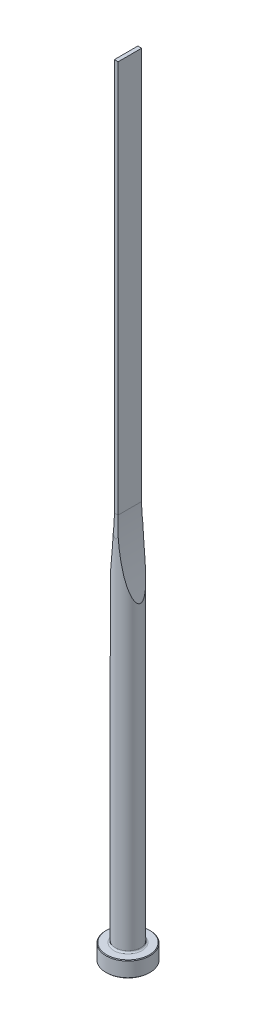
ISO-10303-21;
HEADER;
FILE_DESCRIPTION(('STEP AP214'),'2;1');
FILE_NAME('part.step','',(''),(''),'','','');
FILE_SCHEMA(('AUTOMOTIVE_DESIGN { 1 0 10303 214 1 1 1 1 }'));
ENDSEC;
DATA;
#1=APPLICATION_CONTEXT('core data for automotive mechanical design processes');
#2=APPLICATION_PROTOCOL_DEFINITION('international standard','automotive_design',2000,#1);
#3=PRODUCT_CONTEXT('',#1,'mechanical');
#4=PRODUCT('Part','Part','',(#3));
#5=PRODUCT_RELATED_PRODUCT_CATEGORY('part','',(#4));
#6=PRODUCT_DEFINITION_FORMATION('','',#4);
#7=PRODUCT_DEFINITION_CONTEXT('part definition',#1,'design');
#8=PRODUCT_DEFINITION('design','',#6,#7);
#9=PRODUCT_DEFINITION_SHAPE('','',#8);
#10=(LENGTH_UNIT() NAMED_UNIT(*) SI_UNIT(.MILLI.,.METRE.));
#11=(NAMED_UNIT(*) PLANE_ANGLE_UNIT() SI_UNIT($,.RADIAN.));
#12=(NAMED_UNIT(*) SI_UNIT($,.STERADIAN.) SOLID_ANGLE_UNIT());
#13=UNCERTAINTY_MEASURE_WITH_UNIT(LENGTH_MEASURE(1.E-05),#10,'distance_accuracy_value','');
#14=(GEOMETRIC_REPRESENTATION_CONTEXT(3) GLOBAL_UNCERTAINTY_ASSIGNED_CONTEXT((#13)) GLOBAL_UNIT_ASSIGNED_CONTEXT((#10,
#11,#12)) REPRESENTATION_CONTEXT('',''));
#15=CARTESIAN_POINT('',(0.,0.,0.));
#16=DIRECTION('',(0.,0.,1.));
#17=DIRECTION('',(1.,0.,0.));
#18=AXIS2_PLACEMENT_3D('',#15,#16,#17);
#19=CARTESIAN_POINT('',(0.,0.,0.));
#20=DIRECTION('',(0.,1.,0.));
#21=DIRECTION('',(-1.,0.,0.));
#22=AXIS2_PLACEMENT_3D('',#19,#20,#21);
#23=PLANE('',#22);
#24=CARTESIAN_POINT('',(0.,0.,0.));
#25=DIRECTION('',(0.,1.,0.));
#26=DIRECTION('',(-1.,0.,0.));
#27=AXIS2_PLACEMENT_3D('',#24,#25,#26);
#28=CIRCLE('',#27,6.8);
#29=CARTESIAN_POINT('',(-6.8,0.,0.));
#30=VERTEX_POINT('',#29);
#31=EDGE_CURVE('E133',#30,#30,#28,.T.);
#32=ORIENTED_EDGE('',*,*,#31,.F.);
#33=EDGE_LOOP('',(#32));
#34=FACE_BOUND('',#33,.T.);
#35=ADVANCED_FACE('F32',(#34),#23,.F.);
#36=CARTESIAN_POINT('',(0.,0.,0.));
#37=DIRECTION('',(0.,1.,0.));
#38=DIRECTION('',(-1.,0.,0.));
#39=AXIS2_PLACEMENT_3D('',#36,#37,#38);
#40=CONICAL_SURFACE('',#39,6.8,0.785398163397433);
#41=CARTESIAN_POINT('',(0.,0.200000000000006,0.));
#42=DIRECTION('',(0.,1.,0.));
#43=DIRECTION('',(-1.,0.,0.));
#44=AXIS2_PLACEMENT_3D('',#41,#42,#43);
#45=CIRCLE('',#44,7.);
#46=CARTESIAN_POINT('',(-7.,0.200000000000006,0.));
#47=VERTEX_POINT('',#46);
#48=EDGE_CURVE('E130',#47,#47,#45,.T.);
#49=ORIENTED_EDGE('',*,*,#48,.F.);
#50=EDGE_LOOP('',(#49));
#51=FACE_BOUND('',#50,.T.);
#52=ORIENTED_EDGE('',*,*,#31,.T.);
#53=EDGE_LOOP('',(#52));
#54=FACE_BOUND('',#53,.T.);
#55=ADVANCED_FACE('F171',(#51,#54),#40,.T.);
#56=CARTESIAN_POINT('',(0.,250.,0.));
#57=DIRECTION('',(0.,1.,0.));
#58=DIRECTION('',(-1.,0.,0.));
#59=AXIS2_PLACEMENT_3D('',#56,#57,#58);
#60=CYLINDRICAL_SURFACE('',#59,7.);
#61=CARTESIAN_POINT('',(0.,4.8,0.));
#62=DIRECTION('',(0.,1.,0.));
#63=DIRECTION('',(-1.,0.,0.));
#64=AXIS2_PLACEMENT_3D('',#61,#62,#63);
#65=CIRCLE('',#64,7.);
#66=CARTESIAN_POINT('',(-7.,4.8,0.));
#67=VERTEX_POINT('',#66);
#68=EDGE_CURVE('E127',#67,#67,#65,.T.);
#69=ORIENTED_EDGE('',*,*,#68,.F.);
#70=EDGE_LOOP('',(#69));
#71=FACE_BOUND('',#70,.T.);
#72=ORIENTED_EDGE('',*,*,#48,.T.);
#73=EDGE_LOOP('',(#72));
#74=FACE_BOUND('',#73,.T.);
#75=ADVANCED_FACE('F176',(#71,#74),#60,.T.);
#76=CARTESIAN_POINT('',(0.,4.8,0.));
#77=DIRECTION('',(0.,-1.,0.));
#78=DIRECTION('',(1.,0.,0.));
#79=AXIS2_PLACEMENT_3D('',#76,#77,#78);
#80=CONICAL_SURFACE('',#79,7.,0.785398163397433);
#81=CARTESIAN_POINT('',(0.,5.,0.));
#82=DIRECTION('',(0.,1.,0.));
#83=DIRECTION('',(-1.,0.,0.));
#84=AXIS2_PLACEMENT_3D('',#81,#82,#83);
#85=CIRCLE('',#84,6.8);
#86=CARTESIAN_POINT('',(-6.8,5.,0.));
#87=VERTEX_POINT('',#86);
#88=EDGE_CURVE('E124',#87,#87,#85,.T.);
#89=ORIENTED_EDGE('',*,*,#88,.F.);
#90=EDGE_LOOP('',(#89));
#91=FACE_BOUND('',#90,.T.);
#92=ORIENTED_EDGE('',*,*,#68,.T.);
#93=EDGE_LOOP('',(#92));
#94=FACE_BOUND('',#93,.T.);
#95=ADVANCED_FACE('F183',(#91,#94),#80,.T.);
#96=CARTESIAN_POINT('',(6.8,5.,0.));
#97=DIRECTION('',(0.,-1.,0.));
#98=DIRECTION('',(1.,0.,0.));
#99=AXIS2_PLACEMENT_3D('',#96,#97,#98);
#100=PLANE('',#99);
#101=CARTESIAN_POINT('',(0.,5.,0.));
#102=DIRECTION('',(0.,1.,0.));
#103=DIRECTION('',(-1.,0.,0.));
#104=AXIS2_PLACEMENT_3D('',#101,#102,#103);
#105=CIRCLE('',#104,4.50000000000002);
#106=CARTESIAN_POINT('',(-4.50000000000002,5.,0.));
#107=VERTEX_POINT('',#106);
#108=EDGE_CURVE('E121',#107,#107,#105,.T.);
#109=ORIENTED_EDGE('',*,*,#108,.F.);
#110=EDGE_LOOP('',(#109));
#111=FACE_BOUND('',#110,.T.);
#112=ORIENTED_EDGE('',*,*,#88,.T.);
#113=EDGE_LOOP('',(#112));
#114=FACE_BOUND('',#113,.T.);
#115=ADVANCED_FACE('F190',(#111,#114),#100,.F.);
#116=CARTESIAN_POINT('',(0.,5.5,0.));
#117=DIRECTION('',(0.,1.,0.));
#118=DIRECTION('',(-1.,0.,0.));
#119=AXIS2_PLACEMENT_3D('',#116,#117,#118);
#120=TOROIDAL_SURFACE('',#119,4.50000000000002,0.5);
#121=CARTESIAN_POINT('',(0.,5.50000000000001,0.));
#122=DIRECTION('',(0.,1.,0.));
#123=DIRECTION('',(-1.,0.,0.));
#124=AXIS2_PLACEMENT_3D('',#121,#122,#123);
#125=CIRCLE('',#124,4.00000000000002);
#126=CARTESIAN_POINT('',(-4.00000000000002,5.50000000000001,0.));
#127=VERTEX_POINT('',#126);
#128=EDGE_CURVE('E112',#127,#127,#125,.T.);
#129=ORIENTED_EDGE('',*,*,#128,.F.);
#130=EDGE_LOOP('',(#129));
#131=FACE_BOUND('',#130,.T.);
#132=ORIENTED_EDGE('',*,*,#108,.T.);
#133=EDGE_LOOP('',(#132));
#134=FACE_BOUND('',#133,.T.);
#135=ADVANCED_FACE('F168',(#131,#134),#120,.F.);
#136=CARTESIAN_POINT('',(0.,250.,0.));
#137=DIRECTION('',(0.,1.,0.));
#138=DIRECTION('',(-1.,0.,0.));
#139=AXIS2_PLACEMENT_3D('',#136,#137,#138);
#140=CYLINDRICAL_SURFACE('',#139,4.00000000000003);
#141=CARTESIAN_POINT('',(4.00000000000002,100.496122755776,0.));
#142=CARTESIAN_POINT('',(3.99999564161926,100.496137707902,0.0724134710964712));
#143=CARTESIAN_POINT('',(3.99800322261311,100.503176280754,0.144924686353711));
#144=CARTESIAN_POINT('',(3.99031322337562,100.530379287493,0.287279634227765));
#145=CARTESIAN_POINT('',(3.98460601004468,100.550577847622,0.357115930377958));
#146=CARTESIAN_POINT('',(3.96856971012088,100.607453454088,0.507306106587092));
#147=CARTESIAN_POINT('',(3.95749573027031,100.646793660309,0.586551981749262));
#148=CARTESIAN_POINT('',(3.93217275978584,100.737067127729,0.737506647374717));
#149=CARTESIAN_POINT('',(3.91791778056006,100.78802225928,0.809200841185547));
#150=CARTESIAN_POINT('',(3.88934869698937,100.890553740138,0.936273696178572));
#151=CARTESIAN_POINT('',(3.87530210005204,100.941118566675,0.992548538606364));
#152=CARTESIAN_POINT('',(3.84606514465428,101.046758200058,1.10041297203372));
#153=CARTESIAN_POINT('',(3.83087387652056,101.10183659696,1.15199876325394));
#154=CARTESIAN_POINT('',(3.79965336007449,101.215481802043,1.25113546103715));
#155=CARTESIAN_POINT('',(3.78362230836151,101.274056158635,1.29867705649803));
#156=CARTESIAN_POINT('',(3.75099135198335,101.393781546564,1.39011393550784));
#157=CARTESIAN_POINT('',(3.73439162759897,101.454931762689,1.4340103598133));
#158=CARTESIAN_POINT('',(3.69302416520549,101.607984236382,1.53818457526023));
#159=CARTESIAN_POINT('',(3.66802493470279,101.701045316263,1.59666444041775));
#160=CARTESIAN_POINT('',(3.61751018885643,101.890346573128,1.70802585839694));
#161=CARTESIAN_POINT('',(3.59199442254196,101.986588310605,1.76090460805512));
#162=CARTESIAN_POINT('',(3.54064570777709,102.181608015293,1.8620009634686));
#163=CARTESIAN_POINT('',(3.51481230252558,102.28038993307,1.91021067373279));
#164=CARTESIAN_POINT('',(3.46302756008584,102.479816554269,2.00255699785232));
#165=CARTESIAN_POINT('',(3.43707620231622,102.580461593,2.04669286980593));
#166=CARTESIAN_POINT('',(3.35898443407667,102.885539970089,2.17422236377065));
#167=CARTESIAN_POINT('',(3.30684459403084,103.0922129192,2.2522841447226));
#168=CARTESIAN_POINT('',(3.22913547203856,103.405009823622,2.36106736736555));
#169=CARTESIAN_POINT('',(3.20332878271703,103.509686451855,2.39592801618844));
#170=CARTESIAN_POINT('',(3.15191115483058,103.71988125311,2.46317944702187));
#171=CARTESIAN_POINT('',(3.12630021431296,103.825399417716,2.49557025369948));
#172=CARTESIAN_POINT('',(3.05370800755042,104.126877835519,2.5846537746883));
#173=CARTESIAN_POINT('',(3.00701123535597,104.323696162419,2.63867658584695));
#174=CARTESIAN_POINT('',(2.91459477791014,104.719196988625,2.74041090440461));
#175=CARTESIAN_POINT('',(2.86887523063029,104.91787974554,2.78812152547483));
#176=CARTESIAN_POINT('',(2.77851421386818,105.316797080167,2.87818171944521));
#177=CARTESIAN_POINT('',(2.73387326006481,105.517032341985,2.92052876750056));
#178=CARTESIAN_POINT('',(2.64577308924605,105.918693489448,3.00056953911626));
#179=CARTESIAN_POINT('',(2.60231393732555,106.120119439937,3.03826300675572));
#180=CARTESIAN_POINT('',(2.47361423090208,106.726761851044,3.14543682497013));
#181=CARTESIAN_POINT('',(2.39025159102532,107.133459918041,3.20881732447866));
#182=CARTESIAN_POINT('',(2.22888225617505,107.949528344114,3.32292076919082));
#183=CARTESIAN_POINT('',(2.1508742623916,108.3588980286,3.3736467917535));
#184=CARTESIAN_POINT('',(2.00010529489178,109.181213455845,3.4651666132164));
#185=CARTESIAN_POINT('',(1.9273638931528,109.594166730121,3.50592458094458));
#186=CARTESIAN_POINT('',(1.78755023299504,110.421765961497,3.57922983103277));
#187=CARTESIAN_POINT('',(1.72047824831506,110.836411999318,3.61177671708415));
#188=CARTESIAN_POINT('',(1.59216998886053,111.666495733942,3.67014347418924));
#189=CARTESIAN_POINT('',(1.53092595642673,112.081931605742,3.69597236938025));
#190=CARTESIAN_POINT('',(1.41422203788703,112.913914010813,3.74217950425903));
#191=CARTESIAN_POINT('',(1.35876219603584,113.330460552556,3.76255770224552));
#192=CARTESIAN_POINT('',(1.23052997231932,114.34804167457,3.80686626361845));
#193=CARTESIAN_POINT('',(1.16088260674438,114.94957573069,3.82841184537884));
#194=CARTESIAN_POINT('',(1.03372424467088,116.154148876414,3.86468251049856));
#195=CARTESIAN_POINT('',(0.976213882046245,116.75718804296,3.87940723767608));
#196=CARTESIAN_POINT('',(0.873363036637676,117.964535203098,3.90384820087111));
#197=CARTESIAN_POINT('',(0.8280252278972,118.56884344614,3.91356333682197));
#198=CARTESIAN_POINT('',(0.749563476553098,119.778287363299,3.92934517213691));
#199=CARTESIAN_POINT('',(0.716439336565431,120.383423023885,3.93541193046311));
#200=CARTESIAN_POINT('',(0.662359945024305,121.595618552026,3.94487439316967));
#201=CARTESIAN_POINT('',(0.641432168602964,122.202679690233,3.94826407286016));
#202=CARTESIAN_POINT('',(0.611870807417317,123.41711139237,3.95295302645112));
#203=CARTESIAN_POINT('',(0.603237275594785,124.024481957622,3.9542522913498));
#204=CARTESIAN_POINT('',(0.598268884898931,125.23916519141,3.95500702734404));
#205=CARTESIAN_POINT('',(0.601931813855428,125.846477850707,3.95446283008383));
#206=CARTESIAN_POINT('',(0.621549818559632,127.060898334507,3.9514269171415));
#207=CARTESIAN_POINT('',(0.637504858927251,127.668006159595,3.94893520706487));
#208=CARTESIAN_POINT('',(0.681565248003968,128.878067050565,3.94156883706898));
#209=CARTESIAN_POINT('',(0.70959605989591,129.481022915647,3.93670877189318));
#210=CARTESIAN_POINT('',(0.777780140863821,130.686220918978,3.9238072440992));
#211=CARTESIAN_POINT('',(0.817933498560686,131.288463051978,3.91576575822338));
#212=CARTESIAN_POINT('',(0.910362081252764,132.49222316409,3.89531575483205));
#213=CARTESIAN_POINT('',(0.962642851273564,133.09374068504,3.88290523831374));
#214=CARTESIAN_POINT('',(1.07928092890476,134.295443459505,3.85211559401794));
#215=CARTESIAN_POINT('',(1.14363798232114,134.895628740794,3.83373659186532));
#216=CARTESIAN_POINT('',(1.2841505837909,136.092377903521,3.78898225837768));
#217=CARTESIAN_POINT('',(1.36026767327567,136.688947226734,3.76263273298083));
#218=CARTESIAN_POINT('',(1.52436736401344,137.879948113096,3.69919550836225));
#219=CARTESIAN_POINT('',(1.61235107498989,138.474379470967,3.66210680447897));
#220=CARTESIAN_POINT('',(1.7999534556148,139.659858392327,3.57365007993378));
#221=CARTESIAN_POINT('',(1.89956189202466,140.250908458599,3.52229456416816));
#222=CARTESIAN_POINT('',(2.05751784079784,141.134385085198,3.43078434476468));
#223=CARTESIAN_POINT('',(2.11158852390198,141.428334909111,3.39787168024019));
#224=CARTESIAN_POINT('',(2.22252257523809,142.015010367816,3.32637407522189));
#225=CARTESIAN_POINT('',(2.27938579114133,142.307736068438,3.28778944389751));
#226=CARTESIAN_POINT('',(2.37335149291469,142.778974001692,3.22011433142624));
#227=CARTESIAN_POINT('',(2.40960878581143,142.957955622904,3.19310843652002));
#228=CARTESIAN_POINT('',(2.4831226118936,143.315271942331,3.1362816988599));
#229=CARTESIAN_POINT('',(2.52037916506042,143.493606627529,3.10646079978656));
#230=CARTESIAN_POINT('',(2.59587928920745,143.849611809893,3.04365297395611));
#231=CARTESIAN_POINT('',(2.63412337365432,144.027281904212,3.01066437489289));
#232=CARTESIAN_POINT('',(2.71153832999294,144.381723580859,2.94113375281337));
#233=CARTESIAN_POINT('',(2.75070919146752,144.558495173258,2.90459176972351));
#234=CARTESIAN_POINT('',(2.83003427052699,144.911452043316,2.8273627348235));
#235=CARTESIAN_POINT('',(2.87019091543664,145.08763433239,2.78666446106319));
#236=CARTESIAN_POINT('',(2.95130772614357,145.438668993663,2.70060749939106));
#237=CARTESIAN_POINT('',(2.992267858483,145.613521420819,2.6552490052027));
#238=CARTESIAN_POINT('',(3.07485965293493,145.961434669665,2.55915064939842));
#239=CARTESIAN_POINT('',(3.11649075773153,146.134496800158,2.5084150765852));
#240=CARTESIAN_POINT('',(3.20030527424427,146.478470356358,2.40056525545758));
#241=CARTESIAN_POINT('',(3.24248860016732,146.649382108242,2.34345198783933));
#242=CARTESIAN_POINT('',(3.32761650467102,146.990047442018,2.2209449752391));
#243=CARTESIAN_POINT('',(3.37056449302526,147.159773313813,2.1554756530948));
#244=CARTESIAN_POINT('',(3.45650933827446,147.495378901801,2.01478368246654));
#245=CARTESIAN_POINT('',(3.49950619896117,147.661254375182,1.9395508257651));
#246=CARTESIAN_POINT('',(3.58466359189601,147.986063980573,1.77724053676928));
#247=CARTESIAN_POINT('',(3.62682777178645,148.145036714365,1.69024459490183));
#248=CARTESIAN_POINT('',(3.68879218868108,148.37623468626,1.54772713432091));
#249=CARTESIAN_POINT('',(3.70921535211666,148.45202482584,1.49826783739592));
#250=CARTESIAN_POINT('',(3.74941531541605,148.600462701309,1.39462493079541));
#251=CARTESIAN_POINT('',(3.76919236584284,148.673111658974,1.34044318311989));
#252=CARTESIAN_POINT('',(3.81294137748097,148.833065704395,1.21132384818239));
#253=CARTESIAN_POINT('',(3.83662600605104,148.919114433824,1.1347037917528));
#254=CARTESIAN_POINT('',(3.88140503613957,149.080952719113,0.970527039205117));
#255=CARTESIAN_POINT('',(3.90250393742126,149.156760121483,0.882989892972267));
#256=CARTESIAN_POINT('',(3.9339875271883,149.269414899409,0.726495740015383));
#257=CARTESIAN_POINT('',(3.94559651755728,149.310816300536,0.66110458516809));
#258=CARTESIAN_POINT('',(3.96605720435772,149.383629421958,0.524532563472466));
#259=CARTESIAN_POINT('',(3.97491309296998,149.415056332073,0.453360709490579));
#260=CARTESIAN_POINT('',(3.98768281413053,149.460314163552,0.319456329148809));
#261=CARTESIAN_POINT('',(3.99220018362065,149.47629734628,0.257519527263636));
#262=CARTESIAN_POINT('',(3.99832424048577,149.497956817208,0.131735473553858));
#263=CARTESIAN_POINT('',(3.99993382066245,149.503643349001,0.0678901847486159));
#264=CARTESIAN_POINT('',(4.00006223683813,149.504097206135,-0.0599473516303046));
#265=CARTESIAN_POINT('',(3.99857607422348,149.498846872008,-0.123939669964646));
#266=CARTESIAN_POINT('',(3.9926761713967,149.477981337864,-0.250075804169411));
#267=CARTESIAN_POINT('',(3.98825964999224,149.462356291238,-0.312217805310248));
#268=CARTESIAN_POINT('',(3.97527309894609,149.416334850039,-0.450974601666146));
#269=CARTESIAN_POINT('',(3.96586622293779,149.382955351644,-0.526508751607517));
#270=CARTESIAN_POINT('',(3.94398370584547,149.305070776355,-0.671103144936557));
#271=CARTESIAN_POINT('',(3.93150139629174,149.260541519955,-0.740148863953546));
#272=CARTESIAN_POINT('',(3.90656010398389,149.171249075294,-0.861383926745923));
#273=CARTESIAN_POINT('',(3.89441124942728,149.127642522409,-0.914510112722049));
#274=CARTESIAN_POINT('',(3.86899878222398,149.036132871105,-1.01667208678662));
#275=CARTESIAN_POINT('',(3.8557343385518,148.988226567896,-1.06570477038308));
#276=CARTESIAN_POINT('',(3.82836739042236,148.889044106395,-1.1601839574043));
#277=CARTESIAN_POINT('',(3.81426309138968,148.837760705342,-1.20562226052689));
#278=CARTESIAN_POINT('',(3.78546325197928,148.732660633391,-1.29320936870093));
#279=CARTESIAN_POINT('',(3.77076787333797,148.678844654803,-1.33535906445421));
#280=CARTESIAN_POINT('',(3.73512522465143,148.547818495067,-1.43264720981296));
#281=CARTESIAN_POINT('',(3.71397435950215,148.469668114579,-1.48644230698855));
#282=CARTESIAN_POINT('',(3.67112376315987,148.31045464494,-1.58932194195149));
#283=CARTESIAN_POINT('',(3.64942378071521,148.229390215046,-1.63840427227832));
#284=CARTESIAN_POINT('',(3.58375426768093,147.982643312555,-1.77976912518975));
#285=CARTESIAN_POINT('',(3.53927682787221,147.813633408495,-1.86600919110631));
#286=CARTESIAN_POINT('',(3.44977897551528,147.46933164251,-2.02668892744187));
#287=CARTESIAN_POINT('',(3.40475697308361,147.294013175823,-2.10106902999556));
#288=CARTESIAN_POINT('',(3.31494343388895,146.93974151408,-2.24008593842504));
#289=CARTESIAN_POINT('',(3.27015171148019,146.760792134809,-2.30473242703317));
#290=CARTESIAN_POINT('',(3.18612289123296,146.420579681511,-2.41931179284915));
#291=CARTESIAN_POINT('',(3.14683114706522,146.259608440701,-2.47008185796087));
#292=CARTESIAN_POINT('',(3.06878971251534,145.93597257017,-2.56639084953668));
#293=CARTESIAN_POINT('',(3.03004006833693,145.773307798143,-2.61192933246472));
#294=CARTESIAN_POINT('',(2.91473222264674,145.283156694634,-2.74186435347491));
#295=CARTESIAN_POINT('',(2.839149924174,144.953654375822,-2.81953466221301));
#296=CARTESIAN_POINT('',(2.69097804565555,144.290403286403,-2.96126843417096));
#297=CARTESIAN_POINT('',(2.61839496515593,143.956647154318,-3.02530347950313));
#298=CARTESIAN_POINT('',(2.4766639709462,143.286469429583,-3.14238445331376));
#299=CARTESIAN_POINT('',(2.40751642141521,142.950047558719,-3.19542921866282));
#300=CARTESIAN_POINT('',(2.27265074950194,142.274214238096,-3.29271652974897));
#301=CARTESIAN_POINT('',(2.20694335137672,141.934796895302,-3.33693263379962));
#302=CARTESIAN_POINT('',(2.07929343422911,141.254363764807,-3.41793037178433));
#303=CARTESIAN_POINT('',(2.01735109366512,140.913347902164,-3.45471165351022));
#304=CARTESIAN_POINT('',(1.89739134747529,140.230470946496,-3.52202050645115));
#305=CARTESIAN_POINT('',(1.83936902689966,139.888611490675,-3.5525560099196));
#306=CARTESIAN_POINT('',(1.72721773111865,139.203835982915,-3.60841172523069));
#307=CARTESIAN_POINT('',(1.67308875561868,138.860919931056,-3.63373193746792));
#308=CARTESIAN_POINT('',(1.53321874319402,137.940225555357,-3.69573828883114));
#309=CARTESIAN_POINT('',(1.45106925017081,137.361627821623,-3.72841306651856));
#310=CARTESIAN_POINT('',(1.29800476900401,136.2024765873,-3.78441543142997));
#311=CARTESIAN_POINT('',(1.22709062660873,135.621922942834,-3.80774231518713));
#312=CARTESIAN_POINT('',(1.09655325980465,134.459143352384,-3.84736572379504));
#313=CARTESIAN_POINT('',(1.03693331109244,133.876916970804,-3.86366021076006));
#314=CARTESIAN_POINT('',(0.929055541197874,132.711309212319,-3.89100856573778));
#315=CARTESIAN_POINT('',(0.880797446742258,132.127927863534,-3.90206255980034));
#316=CARTESIAN_POINT('',(0.795592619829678,130.95922146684,-3.92032303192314));
#317=CARTESIAN_POINT('',(0.758666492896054,130.373894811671,-3.92752251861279));
#318=CARTESIAN_POINT('',(0.696262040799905,129.202601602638,-3.93906396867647));
#319=CARTESIAN_POINT('',(0.670783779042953,128.616635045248,-3.9434059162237));
#320=CARTESIAN_POINT('',(0.631290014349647,127.444400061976,-3.94992062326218));
#321=CARTESIAN_POINT('',(0.617272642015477,126.858131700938,-3.95209373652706));
#322=CARTESIAN_POINT('',(0.60069967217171,125.685430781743,-3.95464664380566));
#323=CARTESIAN_POINT('',(0.598144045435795,125.098998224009,-3.95502644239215));
#324=CARTESIAN_POINT('',(0.604484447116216,123.928245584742,-3.95406229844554));
#325=CARTESIAN_POINT('',(0.613340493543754,123.343925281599,-3.95272437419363));
#326=CARTESIAN_POINT('',(0.642431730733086,122.175573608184,-3.9481006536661));
#327=CARTESIAN_POINT('',(0.662666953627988,121.591542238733,-3.94481485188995));
#328=CARTESIAN_POINT('',(0.714512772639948,120.423890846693,-3.9357546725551));
#329=CARTESIAN_POINT('',(0.746125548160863,119.840270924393,-3.9299798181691));
#330=CARTESIAN_POINT('',(0.820710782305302,118.673802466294,-3.91508384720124));
#331=CARTESIAN_POINT('',(0.863683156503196,118.090953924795,-3.90596275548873));
#332=CARTESIAN_POINT('',(0.960884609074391,116.927246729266,-3.88319332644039));
#333=CARTESIAN_POINT('',(1.01509506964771,116.346386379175,-3.86955245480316));
#334=CARTESIAN_POINT('',(1.13478238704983,115.185976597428,-3.83616145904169));
#335=CARTESIAN_POINT('',(1.20025961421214,114.606427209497,-3.81641113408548));
#336=CARTESIAN_POINT('',(1.34239625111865,113.449248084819,-3.7687652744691));
#337=CARTESIAN_POINT('',(1.41905154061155,112.871617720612,-3.74087273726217));
#338=CARTESIAN_POINT('',(1.58346740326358,111.718586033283,-3.67430628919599));
#339=CARTESIAN_POINT('',(1.67122682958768,111.143184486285,-3.63563349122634));
#340=CARTESIAN_POINT('',(1.78780397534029,110.425534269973,-3.57832702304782));
#341=CARTESIAN_POINT('',(1.81149456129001,110.281899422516,-3.56640112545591));
#342=CARTESIAN_POINT('',(1.85955822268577,109.994828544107,-3.54157829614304));
#343=CARTESIAN_POINT('',(1.88393129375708,109.851392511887,-3.52868137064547));
#344=CARTESIAN_POINT('',(1.95806984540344,109.421398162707,-3.48842778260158));
#345=CARTESIAN_POINT('',(2.00885380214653,109.135158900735,-3.45950872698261));
#346=CARTESIAN_POINT('',(2.11307968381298,108.563782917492,-3.39685068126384));
#347=CARTESIAN_POINT('',(2.16652076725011,108.278645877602,-3.363113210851));
#348=CARTESIAN_POINT('',(2.27601482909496,107.709609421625,-3.28999715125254));
#349=CARTESIAN_POINT('',(2.33206772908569,107.425709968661,-3.2506187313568));
#350=CARTESIAN_POINT('',(2.4686064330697,106.751253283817,-3.1489365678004));
#351=CARTESIAN_POINT('',(2.55024834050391,106.361367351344,-3.08362075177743));
#352=CARTESIAN_POINT('',(2.67606846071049,105.779655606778,-2.97350542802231));
#353=CARTESIAN_POINT('',(2.71855977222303,105.586307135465,-2.93478510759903));
#354=CARTESIAN_POINT('',(2.80459946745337,105.200842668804,-2.85267651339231));
#355=CARTESIAN_POINT('',(2.84814781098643,105.008726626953,-2.80928841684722));
#356=CARTESIAN_POINT('',(2.95374235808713,104.549844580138,-2.69877172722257));
#357=CARTESIAN_POINT('',(3.01625290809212,104.283797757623,-2.62906697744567));
#358=CARTESIAN_POINT('',(3.14290843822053,103.755449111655,-2.4762960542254));
#359=CARTESIAN_POINT('',(3.207055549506,103.49315294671,-2.39321162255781));
#360=CARTESIAN_POINT('',(3.30572146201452,103.097286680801,-2.25292733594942));
#361=CARTESIAN_POINT('',(3.33993028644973,102.961407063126,-2.20202594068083));
#362=CARTESIAN_POINT('',(3.40842047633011,102.691980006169,-2.09445657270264));
#363=CARTESIAN_POINT('',(3.44270182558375,102.558432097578,-2.03778977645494));
#364=CARTESIAN_POINT('',(3.51102218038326,102.294748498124,-1.91767763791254));
#365=CARTESIAN_POINT('',(3.54506157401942,102.164605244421,-1.85424925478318));
#366=CARTESIAN_POINT('',(3.61259911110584,101.908669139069,-1.71896967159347));
#367=CARTESIAN_POINT('',(3.64609760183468,101.782873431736,-1.64712414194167));
#368=CARTESIAN_POINT('',(3.70554577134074,101.561478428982,-1.50780992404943));
#369=CARTESIAN_POINT('',(3.73169584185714,101.464766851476,-1.44221043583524));
#370=CARTESIAN_POINT('',(3.7827781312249,101.277026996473,-1.30236256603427));
#371=CARTESIAN_POINT('',(3.80770778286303,101.186010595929,-1.22809697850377));
#372=CARTESIAN_POINT('',(3.85567653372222,101.011865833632,-1.06810478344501));
#373=CARTESIAN_POINT('',(3.87869011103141,100.928842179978,-0.982254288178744));
#374=CARTESIAN_POINT('',(3.92082845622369,100.777544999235,-0.797495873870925));
#375=CARTESIAN_POINT('',(3.93996853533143,100.709213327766,-0.69864201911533));
#376=CARTESIAN_POINT('',(3.96488637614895,100.620536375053,-0.532363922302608));
#377=CARTESIAN_POINT('',(3.97287767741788,100.592168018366,-0.469585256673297));
#378=CARTESIAN_POINT('',(3.98603728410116,100.545510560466,-0.340150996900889));
#379=CARTESIAN_POINT('',(3.9912133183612,100.527193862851,-0.273506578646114));
#380=CARTESIAN_POINT('',(3.99645206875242,100.50866430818,-0.171843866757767));
#381=CARTESIAN_POINT('',(3.99777744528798,100.503978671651,-0.137668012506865));
#382=CARTESIAN_POINT('',(3.99955257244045,100.497703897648,-0.0690022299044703));
#383=CARTESIAN_POINT('',(4.00000207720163,100.496115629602,-0.0345122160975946));
#384=CARTESIAN_POINT('',(4.00000000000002,100.496122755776,0.));
#385=B_SPLINE_CURVE_WITH_KNOTS('',3,(#141,#142,#143,#144,#145,#146,#147,#148,#149,#150,#151,
#152,#153,#154,#155,#156,#157,#158,#159,#160,#161,#162,#163,#164,#165,#166,#167,#168,#169,#170,
#171,#172,#173,#174,#175,#176,#177,#178,#179,#180,#181,#182,#183,#184,#185,#186,#187,#188,#189,
#190,#191,#192,#193,#194,#195,#196,#197,#198,#199,#200,#201,#202,#203,#204,#205,#206,#207,#208,
#209,#210,#211,#212,#213,#214,#215,#216,#217,#218,#219,#220,#221,#222,#223,#224,#225,#226,#227,
#228,#229,#230,#231,#232,#233,#234,#235,#236,#237,#238,#239,#240,#241,#242,#243,#244,#245,#246,
#247,#248,#249,#250,#251,#252,#253,#254,#255,#256,#257,#258,#259,#260,#261,#262,#263,#264,#265,
#266,#267,#268,#269,#270,#271,#272,#273,#274,#275,#276,#277,#278,#279,#280,#281,#282,#283,#284,
#285,#286,#287,#288,#289,#290,#291,#292,#293,#294,#295,#296,#297,#298,#299,#300,#301,#302,#303,
#304,#305,#306,#307,#308,#309,#310,#311,#312,#313,#314,#315,#316,#317,#318,#319,#320,#321,#322,
#323,#324,#325,#326,#327,#328,#329,#330,#331,#332,#333,#334,#335,#336,#337,#338,#339,#340,#341,
#342,#343,#344,#345,#346,#347,#348,#349,#350,#351,#352,#353,#354,#355,#356,#357,#358,#359,#360,
#361,#362,#363,#364,#365,#366,#367,#368,#369,#370,#371,#372,#373,#374,#375,#376,#377,#378,#379,
#380,#381,#382,#383,#384),.UNSPECIFIED.,.T.,.F.,(4,2,2,2,2,2,2,2,2,2,2,2,2,2,2,2,2,2,2,2,2,2,2,
2,2,2,2,2,2,2,2,2,2,2,2,2,2,2,2,2,2,2,2,2,2,2,2,2,2,2,2,2,2,2,2,2,2,2,2,2,2,2,2,2,2,2,2,2,2,2,2,
2,2,2,2,2,2,2,2,2,2,2,2,2,2,2,2,2,2,2,2,2,2,2,2,2,2,2,2,2,2,2,2,2,2,2,2,2,2,2,2,2,2,2,2,2,2,2,2,
2,2,4),(0.,0.217071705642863,0.43470857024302,0.700672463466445,0.967141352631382,
1.19765545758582,1.4283547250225,1.65957152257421,1.89071568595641,2.22861679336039,
2.56668621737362,2.90531769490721,3.24401072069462,3.92450632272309,4.26441084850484,
4.60431197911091,5.23228898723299,5.8603540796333,6.48871373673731,7.1171079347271,
8.37667122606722,9.63592791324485,10.8996467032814,12.1634264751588,13.4254997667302,
14.6875827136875,16.5052028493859,18.3229178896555,20.1410319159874,21.9591165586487,
23.7812811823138,25.6034536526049,27.4252983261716,29.2471377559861,31.0578896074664,
32.8686546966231,34.6802493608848,36.4918058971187,38.2975588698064,40.1034808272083,
41.9078248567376,42.8098366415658,43.711799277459,44.2655877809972,44.8193873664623,
45.3734809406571,45.9275682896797,46.4831933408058,47.0387953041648,47.5939574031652,
48.14903425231,48.7095441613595,49.2706449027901,49.8280406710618,50.1062328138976,
50.3843157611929,50.7365369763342,51.0881362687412,51.3222456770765,51.5559968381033,
51.7475528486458,51.9389181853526,52.1305927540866,52.3224495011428,52.5704006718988,
52.8188942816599,53.0279863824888,53.2372356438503,53.4469492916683,53.6566059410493,
53.9480075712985,54.2395450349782,54.8234681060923,55.4102374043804,55.9964190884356,
56.5162238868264,57.0360727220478,58.076226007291,59.1185263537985,60.1609369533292,
61.2064242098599,62.2519609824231,63.2961615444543,64.3403620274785,66.096070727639,
67.8519115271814,69.6082608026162,71.3645678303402,73.1240497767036,74.8835414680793,
76.6427461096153,78.4019462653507,80.1549996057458,81.9080578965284,83.661452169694,
85.4148334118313,87.1653327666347,88.9158896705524,90.6658029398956,92.4155356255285,
92.8537216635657,93.2919048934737,94.1682875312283,95.044394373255,95.9204749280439,
97.1311135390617,97.7362062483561,98.3412759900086,99.1871473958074,100.034183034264,
100.481319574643,100.928365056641,101.374314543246,101.819965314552,102.17888860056,
102.538537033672,102.902391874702,103.264779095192,103.472139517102,103.678927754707,
103.782354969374,103.885811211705),.UNSPECIFIED.);
#386=CARTESIAN_POINT('',(0.774335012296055,119.400901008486,-3.92433501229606));
#387=VERTEX_POINT('',#386);
#388=CARTESIAN_POINT('',(0.7743350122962,119.400901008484,3.92433501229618));
#389=VERTEX_POINT('',#388);
#390=EDGE_CURVE('E138',#387,#389,#385,.T.);
#391=ORIENTED_EDGE('',*,*,#390,.T.);
#392=CARTESIAN_POINT('',(-1.39194109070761,125.,3.74999999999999));
#393=CARTESIAN_POINT('',(-1.39194449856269,125.334099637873,3.75000007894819));
#394=CARTESIAN_POINT('',(-1.38695792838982,125.668209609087,3.75186098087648));
#395=CARTESIAN_POINT('',(-1.36667392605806,126.336077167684,3.75929815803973));
#396=CARTESIAN_POINT('',(-1.35137656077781,126.669834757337,3.76487440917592));
#397=CARTESIAN_POINT('',(-1.3092332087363,127.337406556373,3.77973662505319));
#398=CARTESIAN_POINT('',(-1.28235776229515,127.671218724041,3.7890320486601));
#399=CARTESIAN_POINT('',(-1.21470251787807,128.337193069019,3.81127649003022));
#400=CARTESIAN_POINT('',(-1.17393087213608,128.669356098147,3.82422336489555));
#401=CARTESIAN_POINT('',(-1.09844611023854,129.165763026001,3.84630718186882));
#402=CARTESIAN_POINT('',(-1.07085040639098,129.331144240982,3.85412453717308));
#403=CARTESIAN_POINT('',(-1.0096185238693,129.660899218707,3.87061811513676));
#404=CARTESIAN_POINT('',(-0.975977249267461,129.825272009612,3.87929505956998));
#405=CARTESIAN_POINT('',(-0.900897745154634,130.151793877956,3.89742276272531));
#406=CARTESIAN_POINT('',(-0.859480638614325,130.313947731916,3.90687138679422));
#407=CARTESIAN_POINT('',(-0.788768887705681,130.554515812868,3.92153114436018));
#408=CARTESIAN_POINT('',(-0.763786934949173,130.634208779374,3.92649537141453));
#409=CARTESIAN_POINT('',(-0.710141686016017,130.792326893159,3.93655330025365));
#410=CARTESIAN_POINT('',(-0.681479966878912,130.870752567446,3.9416469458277));
#411=CARTESIAN_POINT('',(-0.619110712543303,131.025914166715,3.9519241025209));
#412=CARTESIAN_POINT('',(-0.585384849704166,131.102642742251,3.95710787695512));
#413=CARTESIAN_POINT('',(-0.51091844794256,131.252489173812,3.96741853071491));
#414=CARTESIAN_POINT('',(-0.47020590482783,131.32561999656,3.97254555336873));
#415=CARTESIAN_POINT('',(-0.405871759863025,131.421768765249,3.979394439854));
#416=CARTESIAN_POINT('',(-0.387100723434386,131.447990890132,3.98127456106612));
#417=CARTESIAN_POINT('',(-0.347340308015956,131.498838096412,3.98494137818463));
#418=CARTESIAN_POINT('',(-0.326345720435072,131.523459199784,3.98672783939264));
#419=CARTESIAN_POINT('',(-0.281381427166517,131.570454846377,3.99015550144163));
#420=CARTESIAN_POINT('',(-0.257378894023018,131.592798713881,3.99179469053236));
#421=CARTESIAN_POINT('',(-0.206002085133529,131.633234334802,3.99477391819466));
#422=CARTESIAN_POINT('',(-0.178643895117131,131.651345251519,3.99611530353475));
#423=CARTESIAN_POINT('',(-0.13319645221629,131.674230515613,3.99781497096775));
#424=CARTESIAN_POINT('',(-0.116315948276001,131.681368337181,3.99834625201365));
#425=CARTESIAN_POINT('',(-0.0816311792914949,131.692886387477,3.99920443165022));
#426=CARTESIAN_POINT('',(-0.0638281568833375,131.697270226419,3.99953159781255));
#427=CARTESIAN_POINT('',(-0.0275781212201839,131.702824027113,3.99994619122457));
#428=CARTESIAN_POINT('',(-0.00912739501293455,131.703970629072,4.00003187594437));
#429=CARTESIAN_POINT('',(0.0276703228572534,131.702829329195,3.99994663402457));
#430=CARTESIAN_POINT('',(0.0460172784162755,131.700540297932,3.99977562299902));
#431=CARTESIAN_POINT('',(0.0805943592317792,131.693127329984,3.99922251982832));
#432=CARTESIAN_POINT('',(0.0968774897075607,131.688240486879,3.99885808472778));
#433=CARTESIAN_POINT('',(0.128581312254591,131.676235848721,3.99796430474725));
#434=CARTESIAN_POINT('',(0.144001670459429,131.669117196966,3.99743489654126));
#435=CARTESIAN_POINT('',(0.185006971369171,131.647151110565,3.99580470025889));
#436=CARTESIAN_POINT('',(0.20961191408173,131.630495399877,3.99457196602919));
#437=CARTESIAN_POINT('',(0.256071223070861,131.593720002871,3.9918627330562));
#438=CARTESIAN_POINT('',(0.277915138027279,131.573587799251,3.99038535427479));
#439=CARTESIAN_POINT('',(0.350665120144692,131.499085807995,3.98494736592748));
#440=CARTESIAN_POINT('',(0.395552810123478,131.438989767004,3.98061079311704));
#441=CARTESIAN_POINT('',(0.47679286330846,131.313343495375,3.97168524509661));
#442=CARTESIAN_POINT('',(0.513090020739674,131.247761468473,3.96709485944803));
#443=CARTESIAN_POINT('',(0.605299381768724,131.063175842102,3.95438947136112));
#444=CARTESIAN_POINT('',(0.655314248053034,130.941243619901,3.9462316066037));
#445=CARTESIAN_POINT('',(0.745376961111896,130.693666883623,3.93019294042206));
#446=CARTESIAN_POINT('',(0.785397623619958,130.568013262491,3.92231294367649));
#447=CARTESIAN_POINT('',(0.858576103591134,130.314360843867,3.90694950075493));
#448=CARTESIAN_POINT('',(0.891716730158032,130.186357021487,3.8994670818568));
#449=CARTESIAN_POINT('',(0.952763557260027,129.929294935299,3.8849977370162));
#450=CARTESIAN_POINT('',(0.98067669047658,129.800238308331,3.87801016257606));
#451=CARTESIAN_POINT('',(1.05809609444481,129.413067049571,3.85789047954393));
#452=CARTESIAN_POINT('',(1.1016106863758,129.153715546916,3.84552636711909));
#453=CARTESIAN_POINT('',(1.17739914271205,128.633248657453,3.82298810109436));
#454=CARTESIAN_POINT('',(1.20966805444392,128.372132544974,3.81281491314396));
#455=CARTESIAN_POINT('',(1.265337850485,127.848421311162,3.7947041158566));
#456=CARTESIAN_POINT('',(1.28872293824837,127.585824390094,3.7867704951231));
#457=CARTESIAN_POINT('',(1.32794213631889,127.059995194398,3.77319404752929));
#458=CARTESIAN_POINT('',(1.34377550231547,126.796762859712,3.76755144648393));
#459=CARTESIAN_POINT('',(1.36866096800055,126.270393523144,3.75858225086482));
#460=CARTESIAN_POINT('',(1.37772460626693,126.007257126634,3.75525171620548));
#461=CARTESIAN_POINT('',(1.38952938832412,125.480822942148,3.75089945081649));
#462=CARTESIAN_POINT('',(1.39227046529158,125.217525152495,3.74987774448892));
#463=CARTESIAN_POINT('',(1.39154941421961,124.691232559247,3.75014538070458));
#464=CARTESIAN_POINT('',(1.38809419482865,124.428237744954,3.75143214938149));
#465=CARTESIAN_POINT('',(1.3748439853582,123.902437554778,3.75630869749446));
#466=CARTESIAN_POINT('',(1.36504925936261,123.63963217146,3.75989838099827));
#467=CARTESIAN_POINT('',(1.33880225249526,123.117044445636,3.76932382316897));
#468=CARTESIAN_POINT('',(1.32241801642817,122.857258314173,3.77513659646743));
#469=CARTESIAN_POINT('',(1.28217391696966,122.338202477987,3.78899593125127));
#470=CARTESIAN_POINT('',(1.25831091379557,122.078933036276,3.79704343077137));
#471=CARTESIAN_POINT('',(1.2016302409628,121.560824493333,3.81536023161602));
#472=CARTESIAN_POINT('',(1.16879164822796,121.301987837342,3.8256347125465));
#473=CARTESIAN_POINT('',(1.09180587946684,120.786236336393,3.8483276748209));
#474=CARTESIAN_POINT('',(1.04766828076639,120.529320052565,3.86074433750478));
#475=CARTESIAN_POINT('',(0.969147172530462,120.145796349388,3.88091053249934));
#476=CARTESIAN_POINT('',(0.940826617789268,120.017916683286,3.88791072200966));
#477=CARTESIAN_POINT('',(0.878848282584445,119.763280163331,3.90238986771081));
#478=CARTESIAN_POINT('',(0.84518301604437,119.636525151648,3.90986948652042));
#479=CARTESIAN_POINT('',(0.770839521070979,119.385481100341,3.92521002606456));
#480=CARTESIAN_POINT('',(0.730184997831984,119.261185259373,3.93306959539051));
#481=CARTESIAN_POINT('',(0.661250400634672,119.077884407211,3.94503185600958));
#482=CARTESIAN_POINT('',(0.636977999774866,119.017373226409,3.94904355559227));
#483=CARTESIAN_POINT('',(0.584962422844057,118.897876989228,3.95708454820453));
#484=CARTESIAN_POINT('',(0.557221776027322,118.838890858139,3.96111382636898));
#485=CARTESIAN_POINT('',(0.496796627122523,118.722903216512,3.96914753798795));
#486=CARTESIAN_POINT('',(0.464075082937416,118.665920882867,3.97315152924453));
#487=CARTESIAN_POINT('',(0.391808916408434,118.556588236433,3.98093309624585));
#488=CARTESIAN_POINT('',(0.352311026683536,118.504209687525,3.98471199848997));
#489=CARTESIAN_POINT('',(0.291384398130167,118.439838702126,3.98940404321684));
#490=CARTESIAN_POINT('',(0.27462663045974,118.4235001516,3.99059997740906));
#491=CARTESIAN_POINT('',(0.239433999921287,118.392634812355,3.99286679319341));
#492=CARTESIAN_POINT('',(0.220996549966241,118.378110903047,3.99393747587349));
#493=CARTESIAN_POINT('',(0.18203801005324,118.351512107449,3.99590377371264));
#494=CARTESIAN_POINT('',(0.16149357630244,118.339470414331,3.99679701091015));
#495=CARTESIAN_POINT('',(0.118575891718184,118.319260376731,3.99829905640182));
#496=CARTESIAN_POINT('',(0.0962092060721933,118.311078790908,3.9989088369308));
#497=CARTESIAN_POINT('',(0.0565412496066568,118.301340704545,3.99963520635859));
#498=CARTESIAN_POINT('',(0.0395386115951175,118.298580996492,3.99984131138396));
#499=CARTESIAN_POINT('',(0.0053098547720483,118.296014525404,4.00003297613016));
#500=CARTESIAN_POINT('',(-0.0119161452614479,118.296206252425,4.00001864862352));
#501=CARTESIAN_POINT('',(-0.0460423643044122,118.299517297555,3.99977139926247));
#502=CARTESIAN_POINT('',(-0.062943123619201,118.302631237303,3.99953887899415));
#503=CARTESIAN_POINT('',(-0.0960472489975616,118.31145199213,3.99888109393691));
#504=CARTESIAN_POINT('',(-0.112249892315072,118.317161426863,3.99845563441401));
#505=CARTESIAN_POINT('',(-0.151566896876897,118.334081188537,3.99719710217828));
#506=CARTESIAN_POINT('',(-0.174103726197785,118.346614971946,3.99626655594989));
#507=CARTESIAN_POINT('',(-0.216979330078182,118.374976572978,3.99416860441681));
#508=CARTESIAN_POINT('',(-0.237311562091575,118.390813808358,3.99300052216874));
#509=CARTESIAN_POINT('',(-0.293164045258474,118.439682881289,3.98941150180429));
#510=CARTESIAN_POINT('',(-0.326182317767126,118.475518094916,3.98679738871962));
#511=CARTESIAN_POINT('',(-0.387204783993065,118.55115260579,3.9813315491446));
#512=CARTESIAN_POINT('',(-0.41519268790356,118.59096415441,3.97847909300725));
#513=CARTESIAN_POINT('',(-0.485402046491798,118.700793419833,3.97068874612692));
#514=CARTESIAN_POINT('',(-0.524314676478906,118.772896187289,3.96565520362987));
#515=CARTESIAN_POINT('',(-0.595699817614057,118.92026946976,3.9555547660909));
#516=CARTESIAN_POINT('',(-0.628155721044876,118.995547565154,3.95048781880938));
#517=CARTESIAN_POINT('',(-0.688605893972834,119.148337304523,3.94040179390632));
#518=CARTESIAN_POINT('',(-0.716575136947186,119.225858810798,3.9353831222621));
#519=CARTESIAN_POINT('',(-0.768950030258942,119.381970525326,3.9254829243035));
#520=CARTESIAN_POINT('',(-0.793360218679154,119.460559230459,3.92060122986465));
#521=CARTESIAN_POINT('',(-0.867663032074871,119.715294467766,3.90511793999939));
#522=CARTESIAN_POINT('',(-0.912146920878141,119.893033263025,3.89483400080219));
#523=CARTESIAN_POINT('',(-0.992112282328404,120.250606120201,3.87522370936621));
#524=CARTESIAN_POINT('',(-1.02758760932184,120.430441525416,3.86589801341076));
#525=CARTESIAN_POINT('',(-1.0918042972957,120.791761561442,3.84825637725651));
#526=CARTESIAN_POINT('',(-1.12053061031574,120.973248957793,3.83994271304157));
#527=CARTESIAN_POINT('',(-1.17251616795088,121.337058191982,3.82438612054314));
#528=CARTESIAN_POINT('',(-1.19577469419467,121.519380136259,3.8171433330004));
#529=CARTESIAN_POINT('',(-1.25866381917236,122.06677787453,3.79707123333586));
#530=CARTESIAN_POINT('',(-1.29147691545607,122.432701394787,3.7858778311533));
#531=CARTESIAN_POINT('',(-1.34282300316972,123.165177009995,3.76795987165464));
#532=CARTESIAN_POINT('',(-1.36137252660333,123.531727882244,3.76123014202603));
#533=CARTESIAN_POINT('',(-1.37978686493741,124.082089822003,3.75449366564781));
#534=CARTESIAN_POINT('',(-1.38435657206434,124.265735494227,3.75280785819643));
#535=CARTESIAN_POINT('',(-1.39043137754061,124.632919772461,3.75056150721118));
#536=CARTESIAN_POINT('',(-1.39193921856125,124.816458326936,3.74999995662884));
#537=CARTESIAN_POINT('',(-1.39194109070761,125.,3.74999999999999));
#538=B_SPLINE_CURVE_WITH_KNOTS('',3,(#392,#393,#394,#395,#396,#397,#398,#399,#400,#401,#402,
#403,#404,#405,#406,#407,#408,#409,#410,#411,#412,#413,#414,#415,#416,#417,#418,#419,#420,#421,
#422,#423,#424,#425,#426,#427,#428,#429,#430,#431,#432,#433,#434,#435,#436,#437,#438,#439,#440,
#441,#442,#443,#444,#445,#446,#447,#448,#449,#450,#451,#452,#453,#454,#455,#456,#457,#458,#459,
#460,#461,#462,#463,#464,#465,#466,#467,#468,#469,#470,#471,#472,#473,#474,#475,#476,#477,#478,
#479,#480,#481,#482,#483,#484,#485,#486,#487,#488,#489,#490,#491,#492,#493,#494,#495,#496,#497,
#498,#499,#500,#501,#502,#503,#504,#505,#506,#507,#508,#509,#510,#511,#512,#513,#514,#515,#516,
#517,#518,#519,#520,#521,#522,#523,#524,#525,#526,#527,#528,#529,#530,#531,#532,#533,#534,#535,
#536,#537),.UNSPECIFIED.,.T.,.F.,(4,2,2,2,2,2,2,2,2,2,2,2,2,2,2,2,2,2,2,2,2,2,2,2,2,2,2,2,2,2,2,
2,2,2,2,2,2,2,2,2,2,2,2,2,2,2,2,2,2,2,2,2,2,2,2,2,2,2,2,2,2,2,2,2,2,2,2,2,2,2,2,2,4),(0.,
1.00227413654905,2.00454177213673,3.00937481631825,4.01361938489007,4.51708131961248,
5.0209696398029,5.52350845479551,5.77444116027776,6.02526668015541,6.27702287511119,
6.52779287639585,6.62462106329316,6.7216813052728,6.81991213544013,6.91768924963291,
6.97250700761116,7.02725275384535,7.08239254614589,7.13755046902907,7.18837076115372,
7.23921058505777,7.32790198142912,7.4169196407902,7.64058495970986,7.86565080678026,
8.26074626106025,8.6569049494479,9.05404189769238,9.45064837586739,10.2400274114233,
11.029753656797,11.8208776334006,12.6120795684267,13.4019298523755,14.1917884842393,
14.9807669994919,15.7697126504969,16.5507124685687,17.3320406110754,18.115205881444,
18.8977095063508,19.2911173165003,19.6850810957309,20.0777341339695,20.273627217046,
20.4693782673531,20.6666634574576,20.8626390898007,20.9328478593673,21.0031666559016,
21.0743722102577,21.1453316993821,21.1967759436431,21.2481938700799,21.2995173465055,
21.3508927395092,21.4278600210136,21.5050498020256,21.6506217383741,21.7966569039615,
22.04227744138,22.2885218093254,22.5360952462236,22.7833501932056,23.3334505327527,
23.8839251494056,24.4356157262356,24.9873787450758,26.0896404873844,27.1906227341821,
27.7417280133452,28.2923394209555),.UNSPECIFIED.);
#539=CARTESIAN_POINT('',(-0.774335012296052,119.400901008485,3.92433501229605));
#540=VERTEX_POINT('',#539);
#541=EDGE_CURVE('E104',#389,#540,#538,.T.);
#542=ORIENTED_EDGE('',*,*,#541,.T.);
#543=CARTESIAN_POINT('',(-4.00000000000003,100.496122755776,0.));
#544=CARTESIAN_POINT('',(-3.99999564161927,100.496137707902,-0.0724134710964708));
#545=CARTESIAN_POINT('',(-3.99800322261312,100.503176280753,-0.144924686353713));
#546=CARTESIAN_POINT('',(-3.99031322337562,100.530379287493,-0.287279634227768));
#547=CARTESIAN_POINT('',(-3.98460601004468,100.550577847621,-0.357115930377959));
#548=CARTESIAN_POINT('',(-3.96856971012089,100.607453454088,-0.507306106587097));
#549=CARTESIAN_POINT('',(-3.95749573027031,100.646793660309,-0.586551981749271));
#550=CARTESIAN_POINT('',(-3.93217275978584,100.737067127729,-0.737506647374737));
#551=CARTESIAN_POINT('',(-3.91791778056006,100.78802225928,-0.809200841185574));
#552=CARTESIAN_POINT('',(-3.88934869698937,100.890553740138,-0.936273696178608));
#553=CARTESIAN_POINT('',(-3.87530210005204,100.941118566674,-0.992548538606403));
#554=CARTESIAN_POINT('',(-3.84606514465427,101.046758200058,-1.10041297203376));
#555=CARTESIAN_POINT('',(-3.83087387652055,101.10183659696,-1.15199876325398));
#556=CARTESIAN_POINT('',(-3.79965336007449,101.215481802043,-1.25113546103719));
#557=CARTESIAN_POINT('',(-3.7836223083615,101.274056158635,-1.29867705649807));
#558=CARTESIAN_POINT('',(-3.75099135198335,101.393781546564,-1.39011393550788));
#559=CARTESIAN_POINT('',(-3.73439162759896,101.454931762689,-1.43401035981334));
#560=CARTESIAN_POINT('',(-3.69302416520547,101.607984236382,-1.53818457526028));
#561=CARTESIAN_POINT('',(-3.66802493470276,101.701045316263,-1.59666444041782));
#562=CARTESIAN_POINT('',(-3.6175101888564,101.890346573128,-1.70802585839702));
#563=CARTESIAN_POINT('',(-3.59199442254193,101.986588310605,-1.76090460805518));
#564=CARTESIAN_POINT('',(-3.54064570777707,102.181608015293,-1.86200096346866));
#565=CARTESIAN_POINT('',(-3.51481230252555,102.28038993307,-1.91021067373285));
#566=CARTESIAN_POINT('',(-3.46302756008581,102.479816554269,-2.00255699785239));
#567=CARTESIAN_POINT('',(-3.43707620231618,102.580461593,-2.04669286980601));
#568=CARTESIAN_POINT('',(-3.35898443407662,102.885539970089,-2.17422236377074));
#569=CARTESIAN_POINT('',(-3.30684459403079,103.0922129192,-2.25228414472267));
#570=CARTESIAN_POINT('',(-3.22913547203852,103.405009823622,-2.36106736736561));
#571=CARTESIAN_POINT('',(-3.20332878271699,103.509686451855,-2.3959280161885));
#572=CARTESIAN_POINT('',(-3.15191115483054,103.71988125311,-2.46317944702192));
#573=CARTESIAN_POINT('',(-3.12630021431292,103.825399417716,-2.49557025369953));
#574=CARTESIAN_POINT('',(-3.05370800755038,104.126877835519,-2.58465377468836));
#575=CARTESIAN_POINT('',(-3.00701123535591,104.323696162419,-2.63867658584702));
#576=CARTESIAN_POINT('',(-2.91459477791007,104.719196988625,-2.74041090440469));
#577=CARTESIAN_POINT('',(-2.86887523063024,104.91787974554,-2.7881215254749));
#578=CARTESIAN_POINT('',(-2.77851421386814,105.316797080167,-2.87818171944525));
#579=CARTESIAN_POINT('',(-2.73387326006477,105.517032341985,-2.92052876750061));
#580=CARTESIAN_POINT('',(-2.645773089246,105.918693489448,-3.00056953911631));
#581=CARTESIAN_POINT('',(-2.60231393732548,106.120119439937,-3.03826300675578));
#582=CARTESIAN_POINT('',(-2.473614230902,106.726761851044,-3.1454368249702));
#583=CARTESIAN_POINT('',(-2.39025159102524,107.133459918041,-3.20881732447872));
#584=CARTESIAN_POINT('',(-2.22888225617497,107.949528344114,-3.32292076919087));
#585=CARTESIAN_POINT('',(-2.15087426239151,108.3588980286,-3.37364679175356));
#586=CARTESIAN_POINT('',(-2.00010529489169,109.181213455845,-3.46516661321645));
#587=CARTESIAN_POINT('',(-1.9273638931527,109.594166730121,-3.50592458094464));
#588=CARTESIAN_POINT('',(-1.78755023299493,110.421765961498,-3.57922983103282));
#589=CARTESIAN_POINT('',(-1.72047824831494,110.836411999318,-3.61177671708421));
#590=CARTESIAN_POINT('',(-1.59216998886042,111.666495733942,-3.67014347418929));
#591=CARTESIAN_POINT('',(-1.53092595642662,112.081931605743,-3.69597236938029));
#592=CARTESIAN_POINT('',(-1.41422203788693,112.913914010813,-3.74217950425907));
#593=CARTESIAN_POINT('',(-1.35876219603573,113.330460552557,-3.76255770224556));
#594=CARTESIAN_POINT('',(-1.2305299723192,114.348041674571,-3.80686626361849));
#595=CARTESIAN_POINT('',(-1.16088260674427,114.949575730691,-3.82841184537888));
#596=CARTESIAN_POINT('',(-1.03372424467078,116.154148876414,-3.86468251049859));
#597=CARTESIAN_POINT('',(-0.976213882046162,116.757188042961,-3.8794072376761));
#598=CARTESIAN_POINT('',(-0.873363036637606,117.964535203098,-3.90384820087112));
#599=CARTESIAN_POINT('',(-0.828025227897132,118.568843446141,-3.91356333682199));
#600=CARTESIAN_POINT('',(-0.749563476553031,119.7782873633,-3.92934517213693));
#601=CARTESIAN_POINT('',(-0.716439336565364,120.383423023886,-3.93541193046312));
#602=CARTESIAN_POINT('',(-0.66235994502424,121.595618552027,-3.94487439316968));
#603=CARTESIAN_POINT('',(-0.641432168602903,122.202679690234,-3.94826407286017));
#604=CARTESIAN_POINT('',(-0.611870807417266,123.417111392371,-3.95295302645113));
#605=CARTESIAN_POINT('',(-0.603237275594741,124.024481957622,-3.95425229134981));
#606=CARTESIAN_POINT('',(-0.598268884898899,125.239165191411,-3.95500702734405));
#607=CARTESIAN_POINT('',(-0.601931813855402,125.846477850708,-3.95446283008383));
#608=CARTESIAN_POINT('',(-0.621549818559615,127.060898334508,-3.9514269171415));
#609=CARTESIAN_POINT('',(-0.637504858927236,127.668006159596,-3.94893520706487));
#610=CARTESIAN_POINT('',(-0.681565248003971,128.878067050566,-3.94156883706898));
#611=CARTESIAN_POINT('',(-0.709596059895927,129.481022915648,-3.93670877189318));
#612=CARTESIAN_POINT('',(-0.777780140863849,130.686220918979,-3.9238072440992));
#613=CARTESIAN_POINT('',(-0.81793349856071,131.288463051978,-3.91576575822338));
#614=CARTESIAN_POINT('',(-0.910362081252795,132.492223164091,-3.89531575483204));
#615=CARTESIAN_POINT('',(-0.962642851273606,133.09374068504,-3.88290523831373));
#616=CARTESIAN_POINT('',(-1.07928092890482,134.295443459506,-3.85211559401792));
#617=CARTESIAN_POINT('',(-1.1436379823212,134.895628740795,-3.8337365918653));
#618=CARTESIAN_POINT('',(-1.28415058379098,136.092377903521,-3.78898225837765));
#619=CARTESIAN_POINT('',(-1.36026767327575,136.688947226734,-3.76263273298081));
#620=CARTESIAN_POINT('',(-1.52436736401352,137.879948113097,-3.69919550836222));
#621=CARTESIAN_POINT('',(-1.61235107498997,138.474379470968,-3.66210680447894));
#622=CARTESIAN_POINT('',(-1.7999534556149,139.659858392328,-3.57365007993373));
#623=CARTESIAN_POINT('',(-1.8995618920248,140.2509084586,-3.52229456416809));
#624=CARTESIAN_POINT('',(-2.05751784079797,141.134385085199,-3.43078434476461));
#625=CARTESIAN_POINT('',(-2.1115885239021,141.428334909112,-3.39787168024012));
#626=CARTESIAN_POINT('',(-2.22252257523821,142.015010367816,-3.32637407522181));
#627=CARTESIAN_POINT('',(-2.27938579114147,142.307736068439,-3.28778944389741));
#628=CARTESIAN_POINT('',(-2.37335149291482,142.778974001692,-3.22011433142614));
#629=CARTESIAN_POINT('',(-2.40960878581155,142.957955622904,-3.19310843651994));
#630=CARTESIAN_POINT('',(-2.4831226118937,143.315271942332,-3.13628169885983));
#631=CARTESIAN_POINT('',(-2.52037916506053,143.49360662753,-3.10646079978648));
#632=CARTESIAN_POINT('',(-2.59587928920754,143.849611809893,-3.04365297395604));
#633=CARTESIAN_POINT('',(-2.6341233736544,144.027281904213,-3.01066437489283));
#634=CARTESIAN_POINT('',(-2.711538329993,144.381723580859,-2.94113375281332));
#635=CARTESIAN_POINT('',(-2.75070919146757,144.558495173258,-2.90459176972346));
#636=CARTESIAN_POINT('',(-2.83003427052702,144.911452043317,-2.82736273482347));
#637=CARTESIAN_POINT('',(-2.87019091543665,145.087634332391,-2.78666446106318));
#638=CARTESIAN_POINT('',(-2.95130772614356,145.438668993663,-2.70060749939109));
#639=CARTESIAN_POINT('',(-2.99226785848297,145.613521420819,-2.65524900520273));
#640=CARTESIAN_POINT('',(-3.07485965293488,145.961434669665,-2.55915064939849));
#641=CARTESIAN_POINT('',(-3.11649075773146,146.134496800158,-2.5084150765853));
#642=CARTESIAN_POINT('',(-3.20030527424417,146.478470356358,-2.40056525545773));
#643=CARTESIAN_POINT('',(-3.2424886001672,146.649382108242,-2.34345198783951));
#644=CARTESIAN_POINT('',(-3.32761650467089,146.990047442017,-2.22094497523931));
#645=CARTESIAN_POINT('',(-3.37056449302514,147.159773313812,-2.155475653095));
#646=CARTESIAN_POINT('',(-3.4565093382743,147.4953789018,-2.01478368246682));
#647=CARTESIAN_POINT('',(-3.49950619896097,147.661254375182,-1.93955082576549));
#648=CARTESIAN_POINT('',(-3.58466359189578,147.986063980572,-1.77724053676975));
#649=CARTESIAN_POINT('',(-3.62682777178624,148.145036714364,-1.69024459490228));
#650=CARTESIAN_POINT('',(-3.68879218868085,148.37623468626,-1.54772713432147));
#651=CARTESIAN_POINT('',(-3.70921535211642,148.452024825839,-1.49826783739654));
#652=CARTESIAN_POINT('',(-3.74941531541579,148.600462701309,-1.39462493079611));
#653=CARTESIAN_POINT('',(-3.76919236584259,148.673111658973,-1.34044318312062));
#654=CARTESIAN_POINT('',(-3.81294137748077,148.833065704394,-1.21132384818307));
#655=CARTESIAN_POINT('',(-3.83662600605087,148.919114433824,-1.1347037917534));
#656=CARTESIAN_POINT('',(-3.88140503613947,149.080952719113,-0.970527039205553));
#657=CARTESIAN_POINT('',(-3.90250393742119,149.156760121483,-0.882989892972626));
#658=CARTESIAN_POINT('',(-3.93398752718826,149.269414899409,-0.72649574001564));
#659=CARTESIAN_POINT('',(-3.94559651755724,149.310816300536,-0.661104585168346));
#660=CARTESIAN_POINT('',(-3.96605720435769,149.383629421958,-0.524532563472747));
#661=CARTESIAN_POINT('',(-3.97491309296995,149.415056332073,-0.453360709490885));
#662=CARTESIAN_POINT('',(-3.98768281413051,149.460314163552,-0.319456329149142));
#663=CARTESIAN_POINT('',(-3.99220018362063,149.47629734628,-0.25751952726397));
#664=CARTESIAN_POINT('',(-3.99832424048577,149.497956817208,-0.1317354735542));
#665=CARTESIAN_POINT('',(-3.99993382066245,149.503643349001,-0.0678901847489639));
#666=CARTESIAN_POINT('',(-4.00006223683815,149.504097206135,0.0599473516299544));
#667=CARTESIAN_POINT('',(-3.9985760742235,149.498846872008,0.1239396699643));
#668=CARTESIAN_POINT('',(-3.99267617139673,149.477981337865,0.250075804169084));
#669=CARTESIAN_POINT('',(-3.98825964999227,149.462356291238,0.312217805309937));
#670=CARTESIAN_POINT('',(-3.97527309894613,149.416334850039,0.450974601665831));
#671=CARTESIAN_POINT('',(-3.96586622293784,149.382955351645,0.526508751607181));
#672=CARTESIAN_POINT('',(-3.94398370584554,149.305070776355,0.671103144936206));
#673=CARTESIAN_POINT('',(-3.93150139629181,149.260541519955,0.740148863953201));
#674=CARTESIAN_POINT('',(-3.90656010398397,149.171249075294,0.861383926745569));
#675=CARTESIAN_POINT('',(-3.89441124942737,149.127642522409,0.914510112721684));
#676=CARTESIAN_POINT('',(-3.8689987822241,149.036132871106,1.01667208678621));
#677=CARTESIAN_POINT('',(-3.85573433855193,148.988226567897,1.06570477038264));
#678=CARTESIAN_POINT('',(-3.82836739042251,148.889044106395,1.16018395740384));
#679=CARTESIAN_POINT('',(-3.81426309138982,148.837760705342,1.20562226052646));
#680=CARTESIAN_POINT('',(-3.78546325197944,148.732660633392,1.29320936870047));
#681=CARTESIAN_POINT('',(-3.77076787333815,148.678844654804,1.33535906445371));
#682=CARTESIAN_POINT('',(-3.73512522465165,148.547818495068,1.4326472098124));
#683=CARTESIAN_POINT('',(-3.71397435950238,148.469668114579,1.486442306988));
#684=CARTESIAN_POINT('',(-3.67112376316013,148.310454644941,1.58932194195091));
#685=CARTESIAN_POINT('',(-3.6494237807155,148.229390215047,1.63840427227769));
#686=CARTESIAN_POINT('',(-3.58375426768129,147.982643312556,1.77976912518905));
#687=CARTESIAN_POINT('',(-3.53927682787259,147.813633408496,1.8660091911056));
#688=CARTESIAN_POINT('',(-3.44977897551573,147.469331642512,2.02668892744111));
#689=CARTESIAN_POINT('',(-3.40475697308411,147.294013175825,2.10106902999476));
#690=CARTESIAN_POINT('',(-3.31494343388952,146.939741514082,2.2400859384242));
#691=CARTESIAN_POINT('',(-3.27015171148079,146.760792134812,2.30473242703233));
#692=CARTESIAN_POINT('',(-3.18612289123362,146.420579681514,2.4193117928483));
#693=CARTESIAN_POINT('',(-3.1468311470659,146.259608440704,2.47008185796));
#694=CARTESIAN_POINT('',(-3.0687897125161,145.935972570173,2.56639084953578));
#695=CARTESIAN_POINT('',(-3.03004006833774,145.773307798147,2.61192933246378));
#696=CARTESIAN_POINT('',(-2.91473222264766,145.283156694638,2.74186435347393));
#697=CARTESIAN_POINT('',(-2.83914992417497,144.953654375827,2.81953466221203));
#698=CARTESIAN_POINT('',(-2.69097804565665,144.290403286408,2.96126843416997));
#699=CARTESIAN_POINT('',(-2.6183949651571,143.956647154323,3.02530347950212));
#700=CARTESIAN_POINT('',(-2.47666397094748,143.286469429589,3.14238445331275));
#701=CARTESIAN_POINT('',(-2.40751642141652,142.950047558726,3.19542921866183));
#702=CARTESIAN_POINT('',(-2.27265074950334,142.274214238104,3.29271652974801));
#703=CARTESIAN_POINT('',(-2.20694335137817,141.934796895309,3.33693263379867));
#704=CARTESIAN_POINT('',(-2.07929343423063,141.254363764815,3.41793037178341));
#705=CARTESIAN_POINT('',(-2.01735109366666,140.913347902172,3.45471165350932));
#706=CARTESIAN_POINT('',(-1.8973913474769,140.230470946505,3.52202050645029));
#707=CARTESIAN_POINT('',(-1.83936902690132,139.888611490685,3.55255600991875));
#708=CARTESIAN_POINT('',(-1.72721773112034,139.203835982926,3.60841172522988));
#709=CARTESIAN_POINT('',(-1.67308875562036,138.860919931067,3.63373193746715));
#710=CARTESIAN_POINT('',(-1.53321874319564,137.940225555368,3.69573828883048));
#711=CARTESIAN_POINT('',(-1.4510692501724,137.361627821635,3.72841306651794));
#712=CARTESIAN_POINT('',(-1.29800476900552,136.202476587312,3.78441543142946));
#713=CARTESIAN_POINT('',(-1.22709062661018,135.621922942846,3.80774231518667));
#714=CARTESIAN_POINT('',(-1.09655325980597,134.459143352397,3.84736572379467));
#715=CARTESIAN_POINT('',(-1.03693331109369,133.876916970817,3.86366021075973));
#716=CARTESIAN_POINT('',(-0.929055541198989,132.711309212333,3.89100856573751));
#717=CARTESIAN_POINT('',(-0.880797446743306,132.127927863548,3.9020625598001));
#718=CARTESIAN_POINT('',(-0.795592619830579,130.959221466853,3.92032303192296));
#719=CARTESIAN_POINT('',(-0.758666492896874,130.373894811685,3.92752251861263));
#720=CARTESIAN_POINT('',(-0.696262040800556,129.202601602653,3.93906396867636));
#721=CARTESIAN_POINT('',(-0.670783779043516,128.616635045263,3.9434059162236));
#722=CARTESIAN_POINT('',(-0.631290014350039,127.444400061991,3.94992062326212));
#723=CARTESIAN_POINT('',(-0.617272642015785,126.858131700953,3.95209373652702));
#724=CARTESIAN_POINT('',(-0.600699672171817,125.685430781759,3.95464664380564));
#725=CARTESIAN_POINT('',(-0.598144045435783,125.098998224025,3.95502644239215));
#726=CARTESIAN_POINT('',(-0.604484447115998,123.928245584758,3.95406229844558));
#727=CARTESIAN_POINT('',(-0.613340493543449,123.343925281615,3.95272437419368));
#728=CARTESIAN_POINT('',(-0.642431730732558,122.175573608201,3.94810065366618));
#729=CARTESIAN_POINT('',(-0.662666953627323,121.59154223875,3.94481485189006));
#730=CARTESIAN_POINT('',(-0.714512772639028,120.423890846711,3.93575467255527));
#731=CARTESIAN_POINT('',(-0.746125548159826,119.840270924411,3.9299798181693));
#732=CARTESIAN_POINT('',(-0.820710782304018,118.673802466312,3.9150838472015));
#733=CARTESIAN_POINT('',(-0.863683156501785,118.090953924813,3.90596275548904));
#734=CARTESIAN_POINT('',(-0.960884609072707,116.927246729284,3.88319332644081));
#735=CARTESIAN_POINT('',(-1.01509506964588,116.346386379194,3.86955245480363));
#736=CARTESIAN_POINT('',(-1.13478238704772,115.185976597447,3.83616145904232));
#737=CARTESIAN_POINT('',(-1.20025961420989,114.606427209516,3.81641113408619));
#738=CARTESIAN_POINT('',(-1.34239625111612,113.449248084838,3.76876527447));
#739=CARTESIAN_POINT('',(-1.41905154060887,112.871617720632,3.74087273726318));
#740=CARTESIAN_POINT('',(-1.58346740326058,111.718586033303,3.67430628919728));
#741=CARTESIAN_POINT('',(-1.67122682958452,111.143184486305,3.63563349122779));
#742=CARTESIAN_POINT('',(-1.78780397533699,110.425534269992,3.57832702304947));
#743=CARTESIAN_POINT('',(-1.81149456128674,110.281899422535,3.56640112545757));
#744=CARTESIAN_POINT('',(-1.85955822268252,109.994828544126,3.54157829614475));
#745=CARTESIAN_POINT('',(-1.88393129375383,109.851392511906,3.52868137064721));
#746=CARTESIAN_POINT('',(-1.95806984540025,109.421398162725,3.48842778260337));
#747=CARTESIAN_POINT('',(-2.00885380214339,109.135158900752,3.45950872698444));
#748=CARTESIAN_POINT('',(-2.11307968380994,108.563782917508,3.39685068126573));
#749=CARTESIAN_POINT('',(-2.16652076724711,108.278645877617,3.36311321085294));
#750=CARTESIAN_POINT('',(-2.27601482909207,107.70960942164,3.28999715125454));
#751=CARTESIAN_POINT('',(-2.33206772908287,107.425709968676,3.25061873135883));
#752=CARTESIAN_POINT('',(-2.46860643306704,106.75125328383,3.14893656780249));
#753=CARTESIAN_POINT('',(-2.55024834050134,106.361367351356,3.08362075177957));
#754=CARTESIAN_POINT('',(-2.67606846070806,105.779655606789,2.97350542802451));
#755=CARTESIAN_POINT('',(-2.71855977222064,105.586307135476,2.93478510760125));
#756=CARTESIAN_POINT('',(-2.8045994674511,105.200842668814,2.85267651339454));
#757=CARTESIAN_POINT('',(-2.84814781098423,105.008726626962,2.80928841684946));
#758=CARTESIAN_POINT('',(-2.95374235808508,104.549844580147,2.69877172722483));
#759=CARTESIAN_POINT('',(-3.01625290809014,104.283797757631,2.62906697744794));
#760=CARTESIAN_POINT('',(-3.14290843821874,103.755449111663,2.47629605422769));
#761=CARTESIAN_POINT('',(-3.20705554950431,103.493152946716,2.39321162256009));
#762=CARTESIAN_POINT('',(-3.30572146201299,103.097286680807,2.25292733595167));
#763=CARTESIAN_POINT('',(-3.33993028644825,102.961407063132,2.20202594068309));
#764=CARTESIAN_POINT('',(-3.4084204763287,102.691980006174,2.09445657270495));
#765=CARTESIAN_POINT('',(-3.44270182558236,102.558432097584,2.03778977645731));
#766=CARTESIAN_POINT('',(-3.51102218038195,102.294748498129,1.91767763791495));
#767=CARTESIAN_POINT('',(-3.54506157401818,102.164605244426,1.85424925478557));
#768=CARTESIAN_POINT('',(-3.61259911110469,101.908669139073,1.7189696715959));
#769=CARTESIAN_POINT('',(-3.64609760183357,101.78287343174,1.64712414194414));
#770=CARTESIAN_POINT('',(-3.70554577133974,101.561478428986,1.50780992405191));
#771=CARTESIAN_POINT('',(-3.7316958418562,101.46476685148,1.44221043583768));
#772=CARTESIAN_POINT('',(-3.78277813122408,101.277026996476,1.30236256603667));
#773=CARTESIAN_POINT('',(-3.80770778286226,101.186010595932,1.22809697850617));
#774=CARTESIAN_POINT('',(-3.85567653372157,101.011865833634,1.0681047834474));
#775=CARTESIAN_POINT('',(-3.87869011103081,100.92884217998,0.982254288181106));
#776=CARTESIAN_POINT('',(-3.92082845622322,100.777544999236,0.79749587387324));
#777=CARTESIAN_POINT('',(-3.93996853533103,100.709213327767,0.698642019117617));
#778=CARTESIAN_POINT('',(-3.96488637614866,100.620536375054,0.532363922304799));
#779=CARTESIAN_POINT('',(-3.97287767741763,100.592168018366,0.469585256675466));
#780=CARTESIAN_POINT('',(-3.98603728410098,100.545510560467,0.340150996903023));
#781=CARTESIAN_POINT('',(-3.99121331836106,100.527193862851,0.273506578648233));
#782=CARTESIAN_POINT('',(-3.99645206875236,100.50866430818,0.171843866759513));
#783=CARTESIAN_POINT('',(-3.99777744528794,100.503978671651,0.137668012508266));
#784=CARTESIAN_POINT('',(-3.99955257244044,100.497703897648,0.0690022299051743));
#785=CARTESIAN_POINT('',(-4.00000207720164,100.496115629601,0.0345122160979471));
#786=CARTESIAN_POINT('',(-4.00000000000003,100.496122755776,0.));
#787=B_SPLINE_CURVE_WITH_KNOTS('',3,(#543,#544,#545,#546,#547,#548,#549,#550,#551,#552,#553,
#554,#555,#556,#557,#558,#559,#560,#561,#562,#563,#564,#565,#566,#567,#568,#569,#570,#571,#572,
#573,#574,#575,#576,#577,#578,#579,#580,#581,#582,#583,#584,#585,#586,#587,#588,#589,#590,#591,
#592,#593,#594,#595,#596,#597,#598,#599,#600,#601,#602,#603,#604,#605,#606,#607,#608,#609,#610,
#611,#612,#613,#614,#615,#616,#617,#618,#619,#620,#621,#622,#623,#624,#625,#626,#627,#628,#629,
#630,#631,#632,#633,#634,#635,#636,#637,#638,#639,#640,#641,#642,#643,#644,#645,#646,#647,#648,
#649,#650,#651,#652,#653,#654,#655,#656,#657,#658,#659,#660,#661,#662,#663,#664,#665,#666,#667,
#668,#669,#670,#671,#672,#673,#674,#675,#676,#677,#678,#679,#680,#681,#682,#683,#684,#685,#686,
#687,#688,#689,#690,#691,#692,#693,#694,#695,#696,#697,#698,#699,#700,#701,#702,#703,#704,#705,
#706,#707,#708,#709,#710,#711,#712,#713,#714,#715,#716,#717,#718,#719,#720,#721,#722,#723,#724,
#725,#726,#727,#728,#729,#730,#731,#732,#733,#734,#735,#736,#737,#738,#739,#740,#741,#742,#743,
#744,#745,#746,#747,#748,#749,#750,#751,#752,#753,#754,#755,#756,#757,#758,#759,#760,#761,#762,
#763,#764,#765,#766,#767,#768,#769,#770,#771,#772,#773,#774,#775,#776,#777,#778,#779,#780,#781,
#782,#783,#784,#785,#786),.UNSPECIFIED.,.T.,.F.,(4,2,2,2,2,2,2,2,2,2,2,2,2,2,2,2,2,2,2,2,2,2,2,
2,2,2,2,2,2,2,2,2,2,2,2,2,2,2,2,2,2,2,2,2,2,2,2,2,2,2,2,2,2,2,2,2,2,2,2,2,2,2,2,2,2,2,2,2,2,2,2,
2,2,2,2,2,2,2,2,2,2,2,2,2,2,2,2,2,2,2,2,2,2,2,2,2,2,2,2,2,2,2,2,2,2,2,2,2,2,2,2,2,2,2,2,2,2,2,2,
2,2,4),(0.,0.217071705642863,0.434708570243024,0.700672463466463,0.967141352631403,
1.19765545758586,1.42835472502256,1.65957152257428,1.89071568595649,2.2286167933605,
2.56668621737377,2.90531769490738,3.2440107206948,3.92450632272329,4.26441084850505,
4.60431197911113,5.23228898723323,5.8603540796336,6.48871373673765,7.11710793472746,
8.37667122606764,9.63592791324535,10.899646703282,12.1634264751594,13.425499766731,
14.6875827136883,16.5052028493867,18.3229178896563,20.1410319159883,21.9591165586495,
23.7812811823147,25.6034536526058,27.4252983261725,29.247137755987,31.0578896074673,
32.868654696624,34.6802493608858,36.4918058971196,38.2975588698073,40.1034808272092,
41.9078248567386,42.8098366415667,43.71179927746,44.265587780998,44.819387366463,
45.3734809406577,45.9275682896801,46.483193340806,47.0387953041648,47.593957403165,
48.1490342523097,48.709544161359,49.2706449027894,49.8280406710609,50.1062328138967,
50.384315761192,50.7365369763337,51.0881362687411,51.3222456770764,51.5559968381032,
51.7475528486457,51.9389181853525,52.1305927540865,52.3224495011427,52.5704006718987,
52.8188942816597,53.0279863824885,53.2372356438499,53.4469492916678,53.6566059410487,
53.9480075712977,54.2395450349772,54.8234681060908,55.4102374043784,55.9964190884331,
56.5162238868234,57.0360727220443,58.0762260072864,59.1185263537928,60.1609369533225,
61.2064242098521,62.2519609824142,63.2961615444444,64.3403620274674,66.0960707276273,
67.8519115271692,69.6082608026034,71.3645678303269,73.1240497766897,74.8835414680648,
76.6427461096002,78.4019462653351,80.1549996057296,81.9080578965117,83.6614521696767,
85.4148334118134,87.1653327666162,88.9158896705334,90.665802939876,92.4155356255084,
92.8537216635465,93.2919048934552,94.1682875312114,95.0443943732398,95.9204749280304,
97.1311135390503,97.7362062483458,98.3412759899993,99.1871473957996,100.034183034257,
100.481319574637,100.928365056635,101.374314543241,101.819965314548,102.178888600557,
102.538537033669,102.9023918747,103.26477909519,103.4721395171,103.678927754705,
103.782354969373,103.885811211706),.UNSPECIFIED.);
#788=CARTESIAN_POINT('',(-0.774335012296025,119.400901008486,-3.92433501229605));
#789=VERTEX_POINT('',#788);
#790=EDGE_CURVE('E103',#540,#789,#787,.T.);
#791=ORIENTED_EDGE('',*,*,#790,.T.);
#792=CARTESIAN_POINT('',(0.,118.296456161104,-4.00000000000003));
#793=CARTESIAN_POINT('',(0.0186298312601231,118.296456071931,-4.00000000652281));
#794=CARTESIAN_POINT('',(0.0372596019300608,118.29821947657,-3.99986824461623));
#795=CARTESIAN_POINT('',(0.073907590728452,118.30503837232,-3.99935933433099));
#796=CARTESIAN_POINT('',(0.0919248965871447,118.310098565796,-3.99898183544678));
#797=CARTESIAN_POINT('',(0.131910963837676,118.324791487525,-3.99788772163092));
#798=CARTESIAN_POINT('',(0.153544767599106,118.335315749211,-3.99710516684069));
#799=CARTESIAN_POINT('',(0.194874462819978,118.359616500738,-3.99530398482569));
#800=CARTESIAN_POINT('',(0.214565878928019,118.373400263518,-3.99428482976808));
#801=CARTESIAN_POINT('',(0.266920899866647,118.414915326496,-3.9912268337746));
#802=CARTESIAN_POINT('',(0.297607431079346,118.445090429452,-3.98901640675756));
#803=CARTESIAN_POINT('',(0.354604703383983,118.509262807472,-3.98435297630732));
#804=CARTESIAN_POINT('',(0.380901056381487,118.543272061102,-3.98189921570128));
#805=CARTESIAN_POINT('',(0.444700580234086,118.634137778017,-3.97539947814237));
#806=CARTESIAN_POINT('',(0.479736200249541,118.692700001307,-3.97126338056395));
#807=CARTESIAN_POINT('',(0.544427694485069,118.812761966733,-3.9629088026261));
#808=CARTESIAN_POINT('',(0.574070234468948,118.874268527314,-3.95869014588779));
#809=CARTESIAN_POINT('',(0.6295670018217,118.999335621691,-3.95024514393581));
#810=CARTESIAN_POINT('',(0.655400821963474,119.062905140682,-3.94601887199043));
#811=CARTESIAN_POINT('',(0.704007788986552,119.191098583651,-3.93763562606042));
#812=CARTESIAN_POINT('',(0.726784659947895,119.255721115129,-3.93347857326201));
#813=CARTESIAN_POINT('',(0.79430269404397,119.459017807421,-3.92062463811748));
#814=CARTESIAN_POINT('',(0.834873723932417,119.599083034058,-3.91209042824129));
#815=CARTESIAN_POINT('',(0.908785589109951,119.881164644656,-3.89557581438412));
#816=CARTESIAN_POINT('',(0.942121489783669,120.023182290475,-3.88759579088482));
#817=CARTESIAN_POINT('',(1.00339059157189,120.308737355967,-3.87223557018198));
#818=CARTESIAN_POINT('',(1.03131145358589,120.45227747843,-3.86485676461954));
#819=CARTESIAN_POINT('',(1.08277797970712,120.740178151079,-3.8507524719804));
#820=CARTESIAN_POINT('',(1.10632304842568,120.884538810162,-3.84402707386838));
#821=CARTESIAN_POINT('',(1.17165764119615,121.319246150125,-3.8248294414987));
#822=CARTESIAN_POINT('',(1.2079934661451,121.610459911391,-3.81337666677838));
#823=CARTESIAN_POINT('',(1.26962889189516,122.193666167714,-3.79329064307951));
#824=CARTESIAN_POINT('',(1.29494447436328,122.485656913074,-3.78465331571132));
#825=CARTESIAN_POINT('',(1.33636384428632,123.069807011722,-3.77022699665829));
#826=CARTESIAN_POINT('',(1.35248470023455,123.361965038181,-3.76443273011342));
#827=CARTESIAN_POINT('',(1.37657566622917,123.946680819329,-3.7556889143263));
#828=CARTESIAN_POINT('',(1.38454495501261,124.239238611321,-3.75273965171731));
#829=CARTESIAN_POINT('',(1.39277490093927,124.824963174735,-3.74969291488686));
#830=CARTESIAN_POINT('',(1.39302270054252,125.118130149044,-3.74960019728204));
#831=CARTESIAN_POINT('',(1.38579201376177,125.704331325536,-3.75227882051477));
#832=CARTESIAN_POINT('',(1.37831422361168,125.997365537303,-3.75504990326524));
#833=CARTESIAN_POINT('',(1.35531527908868,126.580610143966,-3.76341202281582));
#834=CARTESIAN_POINT('',(1.33986238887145,126.870823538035,-3.76897911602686));
#835=CARTESIAN_POINT('',(1.30003553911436,127.45066211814,-3.78290402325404));
#836=CARTESIAN_POINT('',(1.27565932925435,127.740287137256,-3.7912625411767));
#837=CARTESIAN_POINT('',(1.21632664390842,128.317779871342,-3.81071127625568));
#838=CARTESIAN_POINT('',(1.1813915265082,128.605649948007,-3.82179597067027));
#839=CARTESIAN_POINT('',(1.0979184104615,129.179254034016,-3.84662929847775));
#840=CARTESIAN_POINT('',(1.04938852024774,129.464989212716,-3.8603763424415));
#841=CARTESIAN_POINT('',(0.975628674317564,129.821718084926,-3.8792237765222));
#842=CARTESIAN_POINT('',(0.95983059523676,129.894727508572,-3.8831709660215));
#843=CARTESIAN_POINT('',(0.926647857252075,130.040385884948,-3.89122283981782));
#844=CARTESIAN_POINT('',(0.909262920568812,130.113034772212,-3.89532755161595));
#845=CARTESIAN_POINT('',(0.854186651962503,130.331184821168,-3.90791782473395));
#846=CARTESIAN_POINT('',(0.813747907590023,130.476019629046,-3.91663352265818));
#847=CARTESIAN_POINT('',(0.744808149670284,130.691531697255,-3.9301149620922));
#848=CARTESIAN_POINT('',(0.720281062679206,130.763491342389,-3.93470459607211));
#849=CARTESIAN_POINT('',(0.667701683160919,130.90609492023,-3.94396939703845));
#850=CARTESIAN_POINT('',(0.63965111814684,130.976739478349,-3.94864452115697));
#851=CARTESIAN_POINT('',(0.579074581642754,131.11538204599,-3.95797977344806));
#852=CARTESIAN_POINT('',(0.546588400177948,131.18339736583,-3.96263969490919));
#853=CARTESIAN_POINT('',(0.475042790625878,131.315832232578,-3.97185899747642));
#854=CARTESIAN_POINT('',(0.436006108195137,131.380263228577,-3.9764186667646));
#855=CARTESIAN_POINT('',(0.374746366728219,131.464218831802,-3.98244219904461));
#856=CARTESIAN_POINT('',(0.356981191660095,131.486954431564,-3.98408269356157));
#857=CARTESIAN_POINT('',(0.319479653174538,131.530855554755,-3.98726604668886));
#858=CARTESIAN_POINT('',(0.299739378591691,131.552017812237,-3.98880870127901));
#859=CARTESIAN_POINT('',(0.25767976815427,131.592161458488,-3.9917479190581));
#860=CARTESIAN_POINT('',(0.235334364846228,131.611116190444,-3.99314268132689));
#861=CARTESIAN_POINT('',(0.187843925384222,131.645163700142,-3.99565698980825));
#862=CARTESIAN_POINT('',(0.162709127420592,131.660269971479,-3.99677749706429));
#863=CARTESIAN_POINT('',(0.1198139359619,131.679925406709,-3.99823870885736));
#864=CARTESIAN_POINT('',(0.102904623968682,131.686302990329,-3.9987137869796));
#865=CARTESIAN_POINT('',(0.0682742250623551,131.696239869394,-3.99945461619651));
#866=CARTESIAN_POINT('',(0.0505543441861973,131.699803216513,-3.99972066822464));
#867=CARTESIAN_POINT('',(0.0146483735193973,131.703726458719,-4.00001361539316));
#868=CARTESIAN_POINT('',(-0.00353978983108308,131.704068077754,-4.00003914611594));
#869=CARTESIAN_POINT('',(-0.0396797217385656,131.701456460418,-3.99984410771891));
#870=CARTESIAN_POINT('',(-0.0576313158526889,131.698500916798,-3.99962336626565));
#871=CARTESIAN_POINT('',(-0.0955935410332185,131.688931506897,-3.99890963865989));
#872=CARTESIAN_POINT('',(-0.115472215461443,131.681806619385,-3.99837864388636));
#873=CARTESIAN_POINT('',(-0.153806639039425,131.664449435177,-3.99708812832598));
#874=CARTESIAN_POINT('',(-0.172259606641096,131.654211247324,-3.99632817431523));
#875=CARTESIAN_POINT('',(-0.218793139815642,131.624325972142,-3.99411638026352));
#876=CARTESIAN_POINT('',(-0.245647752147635,131.602806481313,-3.99252964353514));
#877=CARTESIAN_POINT('',(-0.296002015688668,131.556193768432,-3.9891127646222));
#878=CARTESIAN_POINT('',(-0.319491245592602,131.531089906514,-3.98728189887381));
#879=CARTESIAN_POINT('',(-0.3728365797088,131.467994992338,-3.98270974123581));
#880=CARTESIAN_POINT('',(-0.401388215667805,131.428920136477,-3.9799014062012));
#881=CARTESIAN_POINT('',(-0.454709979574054,131.348247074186,-3.97416018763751));
#882=CARTESIAN_POINT('',(-0.479471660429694,131.306643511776,-3.9712270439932));
#883=CARTESIAN_POINT('',(-0.549719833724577,131.179153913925,-3.96233217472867));
#884=CARTESIAN_POINT('',(-0.590916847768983,131.090931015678,-3.9562999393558));
#885=CARTESIAN_POINT('',(-0.664473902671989,130.915662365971,-3.94458612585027));
#886=CARTESIAN_POINT('',(-0.697146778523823,130.828740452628,-3.93890093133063));
#887=CARTESIAN_POINT('',(-0.757793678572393,130.653243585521,-3.92768335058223));
#888=CARTESIAN_POINT('',(-0.785766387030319,130.564668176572,-3.9221510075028));
#889=CARTESIAN_POINT('',(-0.864508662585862,130.296967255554,-3.90583425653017));
#890=CARTESIAN_POINT('',(-0.909947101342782,130.116273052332,-3.89535736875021));
#891=CARTESIAN_POINT('',(-0.991605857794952,129.752164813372,-3.87536306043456));
#892=CARTESIAN_POINT('',(-1.02779199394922,129.568743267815,-3.86584927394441));
#893=CARTESIAN_POINT('',(-1.09304736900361,129.200901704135,-3.84790729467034));
#894=CARTESIAN_POINT('',(-1.12212788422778,129.016483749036,-3.83947739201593));
#895=CARTESIAN_POINT('',(-1.17482635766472,128.645794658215,-3.82368130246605));
#896=CARTESIAN_POINT('',(-1.19841320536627,128.459518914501,-3.81632125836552));
#897=CARTESIAN_POINT('',(-1.24082173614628,128.086379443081,-3.80274252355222));
#898=CARTESIAN_POINT('',(-1.25964309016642,127.899515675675,-3.79652391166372));
#899=CARTESIAN_POINT('',(-1.30993090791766,127.33818318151,-3.77959903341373));
#900=CARTESIAN_POINT('',(-1.33520415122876,126.963099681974,-3.77062912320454));
#901=CARTESIAN_POINT('',(-1.37209041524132,126.210819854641,-3.7573557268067));
#902=CARTESIAN_POINT('',(-1.3836521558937,125.833620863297,-3.75306976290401));
#903=CARTESIAN_POINT('',(-1.39398708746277,125.079150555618,-3.74924456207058));
#904=CARTESIAN_POINT('',(-1.39276467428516,124.701879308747,-3.74970369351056));
#905=CARTESIAN_POINT('',(-1.37749043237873,123.950584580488,-3.75534039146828));
#906=CARTESIAN_POINT('',(-1.36353898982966,123.576558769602,-3.76048103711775));
#907=CARTESIAN_POINT('',(-1.32166960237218,122.829068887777,-3.77541007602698));
#908=CARTESIAN_POINT('',(-1.29374185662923,122.455605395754,-3.78520173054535));
#909=CARTESIAN_POINT('',(-1.23906524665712,121.897586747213,-3.80329633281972));
#910=CARTESIAN_POINT('',(-1.21876569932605,121.712336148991,-3.80987807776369));
#911=CARTESIAN_POINT('',(-1.17319564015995,121.342496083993,-3.8241589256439));
#912=CARTESIAN_POINT('',(-1.14792560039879,121.157906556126,-3.83185792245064));
#913=CARTESIAN_POINT('',(-1.09140444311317,120.78989723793,-3.84833745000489));
#914=CARTESIAN_POINT('',(-1.06015996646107,120.606476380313,-3.85711677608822));
#915=CARTESIAN_POINT('',(-0.990034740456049,120.241170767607,-3.87571592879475));
#916=CARTESIAN_POINT('',(-0.951157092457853,120.059285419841,-3.88553533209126));
#917=CARTESIAN_POINT('',(-0.895086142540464,119.830326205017,-3.89858469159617));
#918=CARTESIAN_POINT('',(-0.882845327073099,119.782005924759,-3.90137800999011));
#919=CARTESIAN_POINT('',(-0.85749306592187,119.685593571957,-3.9070291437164));
#920=CARTESIAN_POINT('',(-0.844381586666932,119.637501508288,-3.90988696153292));
#921=CARTESIAN_POINT('',(-0.803602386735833,119.493750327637,-3.91854426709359));
#922=CARTESIAN_POINT('',(-0.774466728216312,119.398519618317,-3.92443311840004));
#923=CARTESIAN_POINT('',(-0.698697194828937,119.172423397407,-3.93877228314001));
#924=CARTESIAN_POINT('',(-0.649690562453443,119.0422911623,-3.94731817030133));
#925=CARTESIAN_POINT('',(-0.562740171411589,118.850284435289,-3.96032704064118));
#926=CARTESIAN_POINT('',(-0.530821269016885,118.785697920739,-3.96477581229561));
#927=CARTESIAN_POINT('',(-0.460596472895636,118.660145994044,-3.97355465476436));
#928=CARTESIAN_POINT('',(-0.422313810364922,118.599168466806,-3.97788509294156));
#929=CARTESIAN_POINT('',(-0.361270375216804,118.518468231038,-3.98369054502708));
#930=CARTESIAN_POINT('',(-0.342680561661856,118.495634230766,-3.98534262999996));
#931=CARTESIAN_POINT('',(-0.303331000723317,118.451774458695,-3.98853152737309));
#932=CARTESIAN_POINT('',(-0.282566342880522,118.430752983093,-3.9900680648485));
#933=CARTESIAN_POINT('',(-0.238128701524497,118.391237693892,-3.99296875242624));
#934=CARTESIAN_POINT('',(-0.214417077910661,118.372786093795,-3.99433000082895));
#935=CARTESIAN_POINT('',(-0.163991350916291,118.340557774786,-3.99671543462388));
#936=CARTESIAN_POINT('',(-0.137293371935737,118.326757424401,-3.99774132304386));
#937=CARTESIAN_POINT('',(-0.0918004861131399,118.310060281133,-3.99898468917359));
#938=CARTESIAN_POINT('',(-0.0738076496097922,118.305014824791,-3.99936109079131));
#939=CARTESIAN_POINT('',(-0.0372092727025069,118.298215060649,-3.99986857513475));
#940=CARTESIAN_POINT('',(-0.0186046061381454,118.296456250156,-3.99999999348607));
#941=CARTESIAN_POINT('',(0.,118.296456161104,-4.00000000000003));
#942=B_SPLINE_CURVE_WITH_KNOTS('',3,(#792,#793,#794,#795,#796,#797,#798,#799,#800,#801,#802,
#803,#804,#805,#806,#807,#808,#809,#810,#811,#812,#813,#814,#815,#816,#817,#818,#819,#820,#821,
#822,#823,#824,#825,#826,#827,#828,#829,#830,#831,#832,#833,#834,#835,#836,#837,#838,#839,#840,
#841,#842,#843,#844,#845,#846,#847,#848,#849,#850,#851,#852,#853,#854,#855,#856,#857,#858,#859,
#860,#861,#862,#863,#864,#865,#866,#867,#868,#869,#870,#871,#872,#873,#874,#875,#876,#877,#878,
#879,#880,#881,#882,#883,#884,#885,#886,#887,#888,#889,#890,#891,#892,#893,#894,#895,#896,#897,
#898,#899,#900,#901,#902,#903,#904,#905,#906,#907,#908,#909,#910,#911,#912,#913,#914,#915,#916,
#917,#918,#919,#920,#921,#922,#923,#924,#925,#926,#927,#928,#929,#930,#931,#932,#933,#934,#935,
#936,#937,#938,#939,#940,#941),.UNSPECIFIED.,.T.,.F.,(4,2,2,2,2,2,2,2,2,2,2,2,2,2,2,2,2,2,2,2,2,
2,2,2,2,2,2,2,2,2,2,2,2,2,2,2,2,2,2,2,2,2,2,2,2,2,2,2,2,2,2,2,2,2,2,2,2,2,2,2,2,2,2,2,2,2,2,2,2,
2,2,2,2,2,4),(0.,0.0558118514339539,0.111703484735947,0.183503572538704,0.255465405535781,
0.384020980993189,0.512989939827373,0.717565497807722,0.922640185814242,1.12877657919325,
1.334659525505,1.77253277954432,2.21070374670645,2.64986172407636,3.0890794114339,
3.96983572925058,4.84931047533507,5.72714726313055,6.60507248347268,7.48445951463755,
8.36376730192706,9.23567036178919,10.107793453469,10.9781641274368,11.8480167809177,
12.0724098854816,12.2968423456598,12.7483699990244,12.9768001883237,13.2051188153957,
13.4315095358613,13.6571298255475,13.7437509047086,13.8305470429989,13.918301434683,
14.005743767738,14.059780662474,14.1137396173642,14.1680044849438,14.222307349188,
14.2853257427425,14.3484641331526,14.4512279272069,14.554303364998,14.6993694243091,
14.844754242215,15.1367896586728,15.4157632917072,15.6948148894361,16.2542201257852,
16.815663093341,17.3762092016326,17.9398564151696,18.5035425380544,19.6312973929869,
20.7632568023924,21.8948269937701,23.0175495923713,24.1410606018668,24.7004347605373,
25.2597558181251,25.8184587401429,26.3769351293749,26.5267042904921,26.6764792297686,
26.9757309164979,27.39281295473,27.6091875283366,27.8247888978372,27.9131659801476,
28.0017470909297,28.0916448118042,28.1810786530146,28.2368914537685,28.2926277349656),.UNSPECIFIED.);
#943=EDGE_CURVE('E115',#789,#387,#942,.T.);
#944=ORIENTED_EDGE('',*,*,#943,.T.);
#945=EDGE_LOOP('',(#391,#542,#791,#944));
#946=FACE_BOUND('',#945,.T.);
#947=ORIENTED_EDGE('',*,*,#128,.T.);
#948=EDGE_LOOP('',(#947));
#949=FACE_BOUND('',#948,.T.);
#950=ADVANCED_FACE('F147',(#946,#949),#140,.T.);
#951=CARTESIAN_POINT('',(0.,250.,0.));
#952=DIRECTION('',(0.,-1.,0.));
#953=DIRECTION('',(1.,0.,0.));
#954=AXIS2_PLACEMENT_3D('',#951,#952,#953);
#955=PLANE('',#954);
#956=DIRECTION('',(0.,0.,1.));
#957=VECTOR('',#956,1.);
#958=CARTESIAN_POINT('',(-0.600000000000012,250.,0.));
#959=LINE('',#958,#957);
#960=CARTESIAN_POINT('',(-0.599999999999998,250.,-3.75));
#961=VERTEX_POINT('',#960);
#962=CARTESIAN_POINT('',(-0.600000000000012,250.,3.74999999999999));
#963=VERTEX_POINT('',#962);
#964=EDGE_CURVE('E145',#961,#963,#959,.T.);
#965=ORIENTED_EDGE('',*,*,#964,.T.);
#966=DIRECTION('',(1.,0.,0.));
#967=VECTOR('',#966,1.);
#968=CARTESIAN_POINT('',(-5.,250.,3.75));
#969=LINE('',#968,#967);
#970=CARTESIAN_POINT('',(0.600000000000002,250.,3.75));
#971=VERTEX_POINT('',#970);
#972=EDGE_CURVE('E46',#963,#971,#969,.T.);
#973=ORIENTED_EDGE('',*,*,#972,.T.);
#974=DIRECTION('',(0.,0.,-1.));
#975=VECTOR('',#974,1.);
#976=CARTESIAN_POINT('',(0.599999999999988,250.,0.));
#977=LINE('',#976,#975);
#978=CARTESIAN_POINT('',(0.600000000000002,250.,-3.75));
#979=VERTEX_POINT('',#978);
#980=EDGE_CURVE('E136',#971,#979,#977,.T.);
#981=ORIENTED_EDGE('',*,*,#980,.T.);
#982=DIRECTION('',(1.,0.,0.));
#983=VECTOR('',#982,1.);
#984=CARTESIAN_POINT('',(-5.,250.,-3.75));
#985=LINE('',#984,#983);
#986=EDGE_CURVE('E291',#961,#979,#985,.T.);
#987=ORIENTED_EDGE('',*,*,#986,.F.);
#988=EDGE_LOOP('',(#965,#973,#981,#987));
#989=FACE_BOUND('',#988,.T.);
#990=ADVANCED_FACE('F157',(#989),#955,.F.);
#991=CARTESIAN_POINT('',(90.6,125.,-5.));
#992=DIRECTION('',(0.,0.,1.));
#993=DIRECTION('',(1.,0.,0.));
#994=AXIS2_PLACEMENT_3D('',#991,#992,#993);
#995=CYLINDRICAL_SURFACE('',#994,90.);
#996=DIRECTION('',(0.,0.,1.));
#997=VECTOR('',#996,1.);
#998=CARTESIAN_POINT('',(0.600000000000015,125.,-5.));
#999=LINE('',#998,#997);
#1000=CARTESIAN_POINT('',(0.600000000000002,125.,-3.75000000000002));
#1001=VERTEX_POINT('',#1000);
#1002=CARTESIAN_POINT('',(0.600000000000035,125.,3.74999999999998));
#1003=VERTEX_POINT('',#1002);
#1004=EDGE_CURVE('E108',#1001,#1003,#999,.T.);
#1005=ORIENTED_EDGE('',*,*,#1004,.T.);
#1006=CARTESIAN_POINT('',(90.6,125.,93.75));
#1007=DIRECTION('',(-0.707106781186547,0.,0.707106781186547));
#1008=DIRECTION('',(0.707106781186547,0.,0.707106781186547));
#1009=AXIS2_PLACEMENT_3D('',#1006,#1007,#1008);
#1010=ELLIPSE('',#1009,127.279220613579,90.);
#1011=EDGE_CURVE('E96',#1003,#389,#1010,.T.);
#1012=ORIENTED_EDGE('',*,*,#1011,.T.);
#1013=ORIENTED_EDGE('',*,*,#390,.F.);
#1014=CARTESIAN_POINT('',(90.6,125.,-93.75));
#1015=DIRECTION('',(0.707106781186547,0.,0.707106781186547));
#1016=DIRECTION('',(-0.707106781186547,0.,0.707106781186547));
#1017=AXIS2_PLACEMENT_3D('',#1014,#1015,#1016);
#1018=ELLIPSE('',#1017,127.279220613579,90.);
#1019=EDGE_CURVE('E109',#387,#1001,#1018,.F.);
#1020=ORIENTED_EDGE('',*,*,#1019,.T.);
#1021=EDGE_LOOP('',(#1005,#1012,#1013,#1020));
#1022=FACE_BOUND('',#1021,.T.);
#1023=ADVANCED_FACE('F151',(#1022),#995,.F.);
#1024=CARTESIAN_POINT('',(0.599999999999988,250.,-5.));
#1025=DIRECTION('',(-1.,0.,0.));
#1026=DIRECTION('',(0.,-1.,0.));
#1027=AXIS2_PLACEMENT_3D('',#1024,#1025,#1026);
#1028=PLANE('',#1027);
#1029=ORIENTED_EDGE('',*,*,#980,.F.);
#1030=DIRECTION('',(0.,-1.,0.));
#1031=VECTOR('',#1030,1.);
#1032=CARTESIAN_POINT('',(0.599999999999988,250.,3.75));
#1033=LINE('',#1032,#1031);
#1034=EDGE_CURVE('E289',#971,#1003,#1033,.T.);
#1035=ORIENTED_EDGE('',*,*,#1034,.T.);
#1036=ORIENTED_EDGE('',*,*,#1004,.F.);
#1037=DIRECTION('',(0.,1.,0.));
#1038=VECTOR('',#1037,1.);
#1039=CARTESIAN_POINT('',(0.599999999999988,250.,-3.75));
#1040=LINE('',#1039,#1038);
#1041=EDGE_CURVE('E293',#1001,#979,#1040,.T.);
#1042=ORIENTED_EDGE('',*,*,#1041,.T.);
#1043=EDGE_LOOP('',(#1029,#1035,#1036,#1042));
#1044=FACE_BOUND('',#1043,.T.);
#1045=ADVANCED_FACE('F156',(#1044),#1028,.F.);
#1046=CARTESIAN_POINT('',(-90.6,125.,-5.));
#1047=DIRECTION('',(0.,0.,1.));
#1048=DIRECTION('',(1.,0.,0.));
#1049=AXIS2_PLACEMENT_3D('',#1046,#1047,#1048);
#1050=CYLINDRICAL_SURFACE('',#1049,90.);
#1051=ORIENTED_EDGE('',*,*,#790,.F.);
#1052=CARTESIAN_POINT('',(-90.6,125.,93.75));
#1053=DIRECTION('',(0.707106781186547,0.,0.707106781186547));
#1054=DIRECTION('',(-0.707106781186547,0.,0.707106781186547));
#1055=AXIS2_PLACEMENT_3D('',#1052,#1053,#1054);
#1056=ELLIPSE('',#1055,127.279220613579,90.);
#1057=CARTESIAN_POINT('',(-0.600000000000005,125.,3.74999999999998));
#1058=VERTEX_POINT('',#1057);
#1059=EDGE_CURVE('E93',#540,#1058,#1056,.T.);
#1060=ORIENTED_EDGE('',*,*,#1059,.T.);
#1061=DIRECTION('',(0.,0.,1.));
#1062=VECTOR('',#1061,1.);
#1063=CARTESIAN_POINT('',(-0.599999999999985,125.,-5.));
#1064=LINE('',#1063,#1062);
#1065=CARTESIAN_POINT('',(-0.599999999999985,125.,-3.75000000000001));
#1066=VERTEX_POINT('',#1065);
#1067=EDGE_CURVE('E102',#1066,#1058,#1064,.T.);
#1068=ORIENTED_EDGE('',*,*,#1067,.F.);
#1069=CARTESIAN_POINT('',(-90.6,125.,-93.75));
#1070=DIRECTION('',(-0.707106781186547,0.,0.707106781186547));
#1071=DIRECTION('',(0.707106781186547,0.,0.707106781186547));
#1072=AXIS2_PLACEMENT_3D('',#1069,#1070,#1071);
#1073=ELLIPSE('',#1072,127.279220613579,90.);
#1074=EDGE_CURVE('E298',#1066,#789,#1073,.F.);
#1075=ORIENTED_EDGE('',*,*,#1074,.T.);
#1076=EDGE_LOOP('',(#1051,#1060,#1068,#1075));
#1077=FACE_BOUND('',#1076,.T.);
#1078=ADVANCED_FACE('F100',(#1077),#1050,.F.);
#1079=CARTESIAN_POINT('',(-0.600000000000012,250.,-5.));
#1080=DIRECTION('',(1.,0.,0.));
#1081=DIRECTION('',(0.,1.,0.));
#1082=AXIS2_PLACEMENT_3D('',#1079,#1080,#1081);
#1083=PLANE('',#1082);
#1084=ORIENTED_EDGE('',*,*,#1067,.T.);
#1085=DIRECTION('',(0.,1.,0.));
#1086=VECTOR('',#1085,1.);
#1087=CARTESIAN_POINT('',(-0.600000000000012,250.,3.75));
#1088=LINE('',#1087,#1086);
#1089=EDGE_CURVE('E11',#1058,#963,#1088,.T.);
#1090=ORIENTED_EDGE('',*,*,#1089,.T.);
#1091=ORIENTED_EDGE('',*,*,#964,.F.);
#1092=DIRECTION('',(0.,-1.,0.));
#1093=VECTOR('',#1092,1.);
#1094=CARTESIAN_POINT('',(-0.600000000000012,250.,-3.75));
#1095=LINE('',#1094,#1093);
#1096=EDGE_CURVE('E39',#961,#1066,#1095,.T.);
#1097=ORIENTED_EDGE('',*,*,#1096,.T.);
#1098=EDGE_LOOP('',(#1084,#1090,#1091,#1097));
#1099=FACE_BOUND('',#1098,.T.);
#1100=ADVANCED_FACE('F107',(#1099),#1083,.F.);
#1101=CARTESIAN_POINT('',(-5.,125.,-93.75));
#1102=DIRECTION('',(1.,0.,0.));
#1103=DIRECTION('',(0.,0.,-1.));
#1104=AXIS2_PLACEMENT_3D('',#1101,#1102,#1103);
#1105=CYLINDRICAL_SURFACE('',#1104,90.);
#1106=ORIENTED_EDGE('',*,*,#943,.F.);
#1107=ORIENTED_EDGE('',*,*,#1074,.F.);
#1108=DIRECTION('',(1.,0.,0.));
#1109=VECTOR('',#1108,1.);
#1110=CARTESIAN_POINT('',(-5.,125.,-3.75000000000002));
#1111=LINE('',#1110,#1109);
#1112=EDGE_CURVE('E53',#1066,#1001,#1111,.T.);
#1113=ORIENTED_EDGE('',*,*,#1112,.T.);
#1114=ORIENTED_EDGE('',*,*,#1019,.F.);
#1115=EDGE_LOOP('',(#1106,#1107,#1113,#1114));
#1116=FACE_BOUND('',#1115,.T.);
#1117=ADVANCED_FACE('F245',(#1116),#1105,.F.);
#1118=CARTESIAN_POINT('',(-5.,250.,-3.75));
#1119=DIRECTION('',(0.,0.,1.));
#1120=DIRECTION('',(0.,-1.,0.));
#1121=AXIS2_PLACEMENT_3D('',#1118,#1119,#1120);
#1122=PLANE('',#1121);
#1123=ORIENTED_EDGE('',*,*,#1112,.F.);
#1124=ORIENTED_EDGE('',*,*,#1096,.F.);
#1125=ORIENTED_EDGE('',*,*,#986,.T.);
#1126=ORIENTED_EDGE('',*,*,#1041,.F.);
#1127=EDGE_LOOP('',(#1123,#1124,#1125,#1126));
#1128=FACE_BOUND('',#1127,.T.);
#1129=ADVANCED_FACE('F253',(#1128),#1122,.F.);
#1130=CARTESIAN_POINT('',(-5.,250.,3.75));
#1131=DIRECTION('',(0.,0.,-1.));
#1132=DIRECTION('',(0.,1.,0.));
#1133=AXIS2_PLACEMENT_3D('',#1130,#1131,#1132);
#1134=PLANE('',#1133);
#1135=ORIENTED_EDGE('',*,*,#972,.F.);
#1136=ORIENTED_EDGE('',*,*,#1089,.F.);
#1137=DIRECTION('',(1.,0.,0.));
#1138=VECTOR('',#1137,1.);
#1139=CARTESIAN_POINT('',(-5.,125.,3.74999999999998));
#1140=LINE('',#1139,#1138);
#1141=EDGE_CURVE('E83',#1058,#1003,#1140,.T.);
#1142=ORIENTED_EDGE('',*,*,#1141,.T.);
#1143=ORIENTED_EDGE('',*,*,#1034,.F.);
#1144=EDGE_LOOP('',(#1135,#1136,#1142,#1143));
#1145=FACE_BOUND('',#1144,.T.);
#1146=ADVANCED_FACE('F82',(#1145),#1134,.F.);
#1147=CARTESIAN_POINT('',(-5.,125.,93.75));
#1148=DIRECTION('',(1.,0.,0.));
#1149=DIRECTION('',(0.,0.,-1.));
#1150=AXIS2_PLACEMENT_3D('',#1147,#1148,#1149);
#1151=CYLINDRICAL_SURFACE('',#1150,90.);
#1152=ORIENTED_EDGE('',*,*,#1141,.F.);
#1153=ORIENTED_EDGE('',*,*,#1059,.F.);
#1154=ORIENTED_EDGE('',*,*,#541,.F.);
#1155=ORIENTED_EDGE('',*,*,#1011,.F.);
#1156=EDGE_LOOP('',(#1152,#1153,#1154,#1155));
#1157=FACE_BOUND('',#1156,.T.);
#1158=ADVANCED_FACE('F92',(#1157),#1151,.F.);
#1159=CLOSED_SHELL('',(#35,#55,#75,#95,#115,#135,#950,#990,#1023,#1045,#1078,#1100,#1117,#1129,
#1146,#1158));
#1160=MANIFOLD_SOLID_BREP('B2',#1159);
#1161=ADVANCED_BREP_SHAPE_REPRESENTATION('',(#18,#1160),#14);
#1162=SHAPE_DEFINITION_REPRESENTATION(#9,#1161);
ENDSEC;
END-ISO-10303-21;
